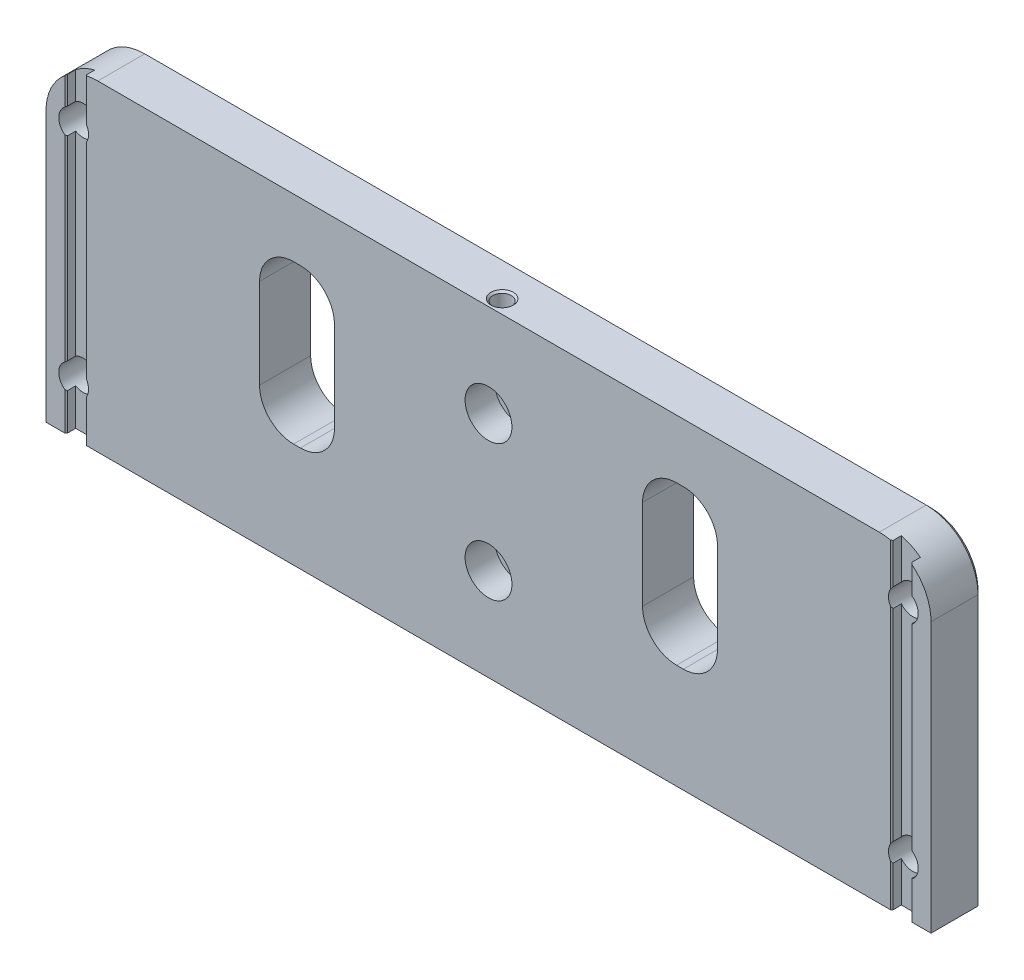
ISO-10303-21;
HEADER;
FILE_DESCRIPTION(('STEP AP214'),'2;1');
FILE_NAME('part.step','',(''),(''),'','','');
FILE_SCHEMA(('AUTOMOTIVE_DESIGN { 1 0 10303 214 1 1 1 1 }'));
ENDSEC;
DATA;
#1=APPLICATION_CONTEXT('core data for automotive mechanical design processes');
#2=APPLICATION_PROTOCOL_DEFINITION('international standard','automotive_design',2000,#1);
#3=PRODUCT_CONTEXT('',#1,'mechanical');
#4=PRODUCT('Part','Part','',(#3));
#5=PRODUCT_RELATED_PRODUCT_CATEGORY('part','',(#4));
#6=PRODUCT_DEFINITION_FORMATION('','',#4);
#7=PRODUCT_DEFINITION_CONTEXT('part definition',#1,'design');
#8=PRODUCT_DEFINITION('design','',#6,#7);
#9=PRODUCT_DEFINITION_SHAPE('','',#8);
#10=(LENGTH_UNIT() NAMED_UNIT(*) SI_UNIT(.MILLI.,.METRE.));
#11=(NAMED_UNIT(*) PLANE_ANGLE_UNIT() SI_UNIT($,.RADIAN.));
#12=(NAMED_UNIT(*) SI_UNIT($,.STERADIAN.) SOLID_ANGLE_UNIT());
#13=UNCERTAINTY_MEASURE_WITH_UNIT(LENGTH_MEASURE(1.E-05),#10,'distance_accuracy_value','');
#14=(GEOMETRIC_REPRESENTATION_CONTEXT(3) GLOBAL_UNCERTAINTY_ASSIGNED_CONTEXT((#13)) GLOBAL_UNIT_ASSIGNED_CONTEXT((#10,
#11,#12)) REPRESENTATION_CONTEXT('',''));
#15=CARTESIAN_POINT('',(0.,0.,0.));
#16=DIRECTION('',(0.,0.,1.));
#17=DIRECTION('',(1.,0.,0.));
#18=AXIS2_PLACEMENT_3D('',#15,#16,#17);
#19=CARTESIAN_POINT('',(78.7654,60.198,-16.256));
#20=DIRECTION('',(0.,-1.,0.));
#21=DIRECTION('',(1.,0.,0.));
#22=AXIS2_PLACEMENT_3D('',#19,#20,#21);
#23=PLANE('',#22);
#24=DIRECTION('',(0.,0.,1.));
#25=VECTOR('',#24,1.);
#26=CARTESIAN_POINT('',(72.8726,60.198,-25.781));
#27=LINE('',#26,#25);
#28=CARTESIAN_POINT('',(72.8726,60.198,-16.256));
#29=VERTEX_POINT('',#28);
#30=CARTESIAN_POINT('',(72.8726,60.198,-25.019));
#31=VERTEX_POINT('',#30);
#32=EDGE_CURVE('E808',#29,#31,#27,.F.);
#33=ORIENTED_EDGE('',*,*,#32,.T.);
#34=DIRECTION('',(-1.,0.,0.));
#35=VECTOR('',#34,1.);
#36=CARTESIAN_POINT('',(-72.8726,60.198,-25.019));
#37=LINE('',#36,#35);
#38=CARTESIAN_POINT('',(-72.8726,60.198,-25.019));
#39=VERTEX_POINT('',#38);
#40=EDGE_CURVE('E845',#31,#39,#37,.T.);
#41=ORIENTED_EDGE('',*,*,#40,.T.);
#42=DIRECTION('',(0.,0.,1.));
#43=VECTOR('',#42,1.);
#44=CARTESIAN_POINT('',(-72.8726,60.198,-16.256));
#45=LINE('',#44,#43);
#46=CARTESIAN_POINT('',(-72.8726,60.198,-16.256));
#47=VERTEX_POINT('',#46);
#48=EDGE_CURVE('E806',#39,#47,#45,.T.);
#49=ORIENTED_EDGE('',*,*,#48,.T.);
#50=DIRECTION('',(-1.,0.,0.));
#51=VECTOR('',#50,1.);
#52=CARTESIAN_POINT('',(73.8378,60.198,-16.256));
#53=LINE('',#52,#51);
#54=EDGE_CURVE('E540',#29,#47,#53,.T.);
#55=ORIENTED_EDGE('',*,*,#54,.F.);
#56=EDGE_LOOP('',(#33,#41,#49,#55));
#57=FACE_BOUND('',#56,.T.);
#58=DIRECTION('',(0.999999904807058,0.,0.000436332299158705));
#59=VECTOR('',#58,1.);
#60=CARTESIAN_POINT('',(2.08279980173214,60.198,-18.7950912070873));
#61=LINE('',#60,#59);
#62=CARTESIAN_POINT('',(2.08305380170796,60.198,-18.7950910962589));
#63=VERTEX_POINT('',#62);
#64=CARTESIAN_POINT('',(2.08279980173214,60.198,-18.7950912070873));
#65=VERTEX_POINT('',#64);
#66=EDGE_CURVE('E957',#63,#65,#61,.F.);
#67=ORIENTED_EDGE('',*,*,#66,.F.);
#68=CARTESIAN_POINT('',(0.,60.198,-18.796));
#69=DIRECTION('',(0.,1.,0.));
#70=DIRECTION('',(0.,0.,1.));
#71=AXIS2_PLACEMENT_3D('',#68,#69,#70);
#72=CIRCLE('',#71,2.083054);
#73=CARTESIAN_POINT('',(2.083054,60.198,-18.796));
#74=VERTEX_POINT('',#73);
#75=EDGE_CURVE('E988',#74,#63,#72,.T.);
#76=ORIENTED_EDGE('',*,*,#75,.F.);
#77=DIRECTION('',(1.,0.,0.));
#78=VECTOR('',#77,1.);
#79=CARTESIAN_POINT('',(2.0828,60.198,-18.796));
#80=LINE('',#79,#78);
#81=CARTESIAN_POINT('',(2.0828,60.198,-18.796));
#82=VERTEX_POINT('',#81);
#83=EDGE_CURVE('E19',#74,#82,#80,.F.);
#84=ORIENTED_EDGE('',*,*,#83,.T.);
#85=CARTESIAN_POINT('',(0.,60.198,-18.796));
#86=DIRECTION('',(0.,-1.,0.));
#87=DIRECTION('',(1.,0.,0.));
#88=AXIS2_PLACEMENT_3D('',#85,#86,#87);
#89=CIRCLE('',#88,2.0828);
#90=EDGE_CURVE('E25',#82,#65,#89,.T.);
#91=ORIENTED_EDGE('',*,*,#90,.T.);
#92=EDGE_LOOP('',(#67,#76,#84,#91));
#93=FACE_BOUND('',#92,.T.);
#94=ADVANCED_FACE('F15',(#57,#93),#23,.F.);
#95=CARTESIAN_POINT('',(-82.5246,60.198,-25.781));
#96=DIRECTION('',(0.,0.,-1.));
#97=DIRECTION('',(-1.,0.,0.));
#98=AXIS2_PLACEMENT_3D('',#95,#96,#97);
#99=PLANE('',#98);
#100=DIRECTION('',(1.,0.,0.));
#101=VECTOR('',#100,1.);
#102=CARTESIAN_POINT('',(72.8726,59.436,-25.781));
#103=LINE('',#102,#101);
#104=CARTESIAN_POINT('',(-72.8726,59.436,-25.781));
#105=VERTEX_POINT('',#104);
#106=CARTESIAN_POINT('',(72.8726,59.436,-25.781));
#107=VERTEX_POINT('',#106);
#108=EDGE_CURVE('E825',#105,#107,#103,.T.);
#109=ORIENTED_EDGE('',*,*,#108,.T.);
#110=CARTESIAN_POINT('',(72.8726,50.546,-25.781));
#111=DIRECTION('',(0.,0.,-1.));
#112=DIRECTION('',(-1.,0.,0.));
#113=AXIS2_PLACEMENT_3D('',#110,#111,#112);
#114=CIRCLE('',#113,8.89);
#115=CARTESIAN_POINT('',(81.7626,50.546,-25.781));
#116=VERTEX_POINT('',#115);
#117=EDGE_CURVE('E833',#107,#116,#114,.T.);
#118=ORIENTED_EDGE('',*,*,#117,.T.);
#119=DIRECTION('',(0.,-1.,0.));
#120=VECTOR('',#119,1.);
#121=CARTESIAN_POINT('',(81.7626,60.198,-25.781));
#122=LINE('',#121,#120);
#123=CARTESIAN_POINT('',(81.7626,1.016,-25.781));
#124=VERTEX_POINT('',#123);
#125=EDGE_CURVE('E831',#116,#124,#122,.T.);
#126=ORIENTED_EDGE('',*,*,#125,.T.);
#127=DIRECTION('',(-1.,0.,0.));
#128=VECTOR('',#127,1.);
#129=CARTESIAN_POINT('',(-82.5246,1.016,-25.781));
#130=LINE('',#129,#128);
#131=CARTESIAN_POINT('',(-81.7626,1.016,-25.781));
#132=VERTEX_POINT('',#131);
#133=EDGE_CURVE('E829',#124,#132,#130,.T.);
#134=ORIENTED_EDGE('',*,*,#133,.T.);
#135=DIRECTION('',(0.,1.,0.));
#136=VECTOR('',#135,1.);
#137=CARTESIAN_POINT('',(-81.7626,50.546,-25.781));
#138=LINE('',#137,#136);
#139=CARTESIAN_POINT('',(-81.7626,50.546,-25.781));
#140=VERTEX_POINT('',#139);
#141=EDGE_CURVE('E827',#132,#140,#138,.T.);
#142=ORIENTED_EDGE('',*,*,#141,.T.);
#143=CARTESIAN_POINT('',(-72.8726,50.546,-25.781));
#144=DIRECTION('',(0.,0.,-1.));
#145=DIRECTION('',(-1.,0.,0.));
#146=AXIS2_PLACEMENT_3D('',#143,#144,#145);
#147=CIRCLE('',#146,8.89);
#148=EDGE_CURVE('E823',#140,#105,#147,.T.);
#149=ORIENTED_EDGE('',*,*,#148,.T.);
#150=EDGE_LOOP('',(#109,#118,#126,#134,#142,#149));
#151=FACE_BOUND('',#150,.T.);
#152=CARTESIAN_POINT('',(0.,42.926,-25.780999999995));
#153=DIRECTION('',(0.,0.,-1.));
#154=DIRECTION('',(-1.,0.,0.));
#155=AXIS2_PLACEMENT_3D('',#152,#153,#154);
#156=CIRCLE('',#155,2.778125);
#157=CARTESIAN_POINT('',(-2.778125,42.926,-25.780999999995));
#158=VERTEX_POINT('',#157);
#159=EDGE_CURVE('E664',#158,#158,#156,.T.);
#160=ORIENTED_EDGE('',*,*,#159,.F.);
#161=EDGE_LOOP('',(#160));
#162=FACE_BOUND('',#161,.T.);
#163=CARTESIAN_POINT('',(0.,17.526,-25.780999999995));
#164=DIRECTION('',(0.,0.,-1.));
#165=DIRECTION('',(-1.,0.,0.));
#166=AXIS2_PLACEMENT_3D('',#163,#164,#165);
#167=CIRCLE('',#166,2.778125);
#168=CARTESIAN_POINT('',(-2.778125,17.526,-25.780999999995));
#169=VERTEX_POINT('',#168);
#170=EDGE_CURVE('E579',#169,#169,#167,.T.);
#171=ORIENTED_EDGE('',*,*,#170,.F.);
#172=EDGE_LOOP('',(#171));
#173=FACE_BOUND('',#172,.T.);
#174=DIRECTION('',(0.,1.,0.));
#175=VECTOR('',#174,1.);
#176=CARTESIAN_POINT('',(42.6974,60.198,-25.781));
#177=LINE('',#176,#175);
#178=CARTESIAN_POINT('',(42.6974,26.162,-25.781));
#179=VERTEX_POINT('',#178);
#180=CARTESIAN_POINT('',(42.6974,42.926,-25.781));
#181=VERTEX_POINT('',#180);
#182=EDGE_CURVE('E703',#179,#181,#177,.T.);
#183=ORIENTED_EDGE('',*,*,#182,.T.);
#184=CARTESIAN_POINT('',(36.3474,42.926,-25.781));
#185=DIRECTION('',(0.,0.,-1.));
#186=DIRECTION('',(-1.,0.,0.));
#187=AXIS2_PLACEMENT_3D('',#184,#185,#186);
#188=CIRCLE('',#187,6.35);
#189=CARTESIAN_POINT('',(36.3474,49.276,-25.781));
#190=VERTEX_POINT('',#189);
#191=EDGE_CURVE('E680',#181,#190,#188,.F.);
#192=ORIENTED_EDGE('',*,*,#191,.T.);
#193=DIRECTION('',(-1.,0.,0.));
#194=VECTOR('',#193,1.);
#195=CARTESIAN_POINT('',(-82.5246,49.276,-25.781));
#196=LINE('',#195,#194);
#197=CARTESIAN_POINT('',(35.0774,49.276,-25.781));
#198=VERTEX_POINT('',#197);
#199=EDGE_CURVE('E706',#190,#198,#196,.T.);
#200=ORIENTED_EDGE('',*,*,#199,.T.);
#201=CARTESIAN_POINT('',(35.0774,42.926,-25.781));
#202=DIRECTION('',(0.,0.,-1.));
#203=DIRECTION('',(-1.,0.,0.));
#204=AXIS2_PLACEMENT_3D('',#201,#202,#203);
#205=CIRCLE('',#204,6.35);
#206=CARTESIAN_POINT('',(28.7274,42.926,-25.781));
#207=VERTEX_POINT('',#206);
#208=EDGE_CURVE('E748',#198,#207,#205,.F.);
#209=ORIENTED_EDGE('',*,*,#208,.T.);
#210=DIRECTION('',(0.,-1.,0.));
#211=VECTOR('',#210,1.);
#212=CARTESIAN_POINT('',(28.7274,60.198,-25.781));
#213=LINE('',#212,#211);
#214=CARTESIAN_POINT('',(28.7274,26.162,-25.781));
#215=VERTEX_POINT('',#214);
#216=EDGE_CURVE('E771',#207,#215,#213,.T.);
#217=ORIENTED_EDGE('',*,*,#216,.T.);
#218=CARTESIAN_POINT('',(35.0774,26.162,-25.781));
#219=DIRECTION('',(0.,0.,-1.));
#220=DIRECTION('',(-1.,0.,0.));
#221=AXIS2_PLACEMENT_3D('',#218,#219,#220);
#222=CIRCLE('',#221,6.35);
#223=CARTESIAN_POINT('',(35.0774,19.812,-25.781));
#224=VERTEX_POINT('',#223);
#225=EDGE_CURVE('E697',#215,#224,#222,.F.);
#226=ORIENTED_EDGE('',*,*,#225,.T.);
#227=DIRECTION('',(1.,0.,0.));
#228=VECTOR('',#227,1.);
#229=CARTESIAN_POINT('',(-82.5246,19.812,-25.781));
#230=LINE('',#229,#228);
#231=CARTESIAN_POINT('',(36.3474,19.812,-25.781));
#232=VERTEX_POINT('',#231);
#233=EDGE_CURVE('E571',#224,#232,#230,.T.);
#234=ORIENTED_EDGE('',*,*,#233,.T.);
#235=CARTESIAN_POINT('',(36.3474,26.162,-25.781));
#236=DIRECTION('',(0.,0.,-1.));
#237=DIRECTION('',(-1.,0.,0.));
#238=AXIS2_PLACEMENT_3D('',#235,#236,#237);
#239=CIRCLE('',#238,6.35);
#240=EDGE_CURVE('E689',#232,#179,#239,.F.);
#241=ORIENTED_EDGE('',*,*,#240,.T.);
#242=EDGE_LOOP('',(#183,#192,#200,#209,#217,#226,#234,#241));
#243=FACE_BOUND('',#242,.T.);
#244=CARTESIAN_POINT('',(-77.3684,50.673,-25.781));
#245=DIRECTION('',(0.,0.,-1.));
#246=DIRECTION('',(-1.,0.,0.));
#247=AXIS2_PLACEMENT_3D('',#244,#245,#246);
#248=CIRCLE('',#247,2.778125);
#249=CARTESIAN_POINT('',(-80.146525,50.673,-25.781));
#250=VERTEX_POINT('',#249);
#251=EDGE_CURVE('E567',#250,#250,#248,.T.);
#252=ORIENTED_EDGE('',*,*,#251,.F.);
#253=EDGE_LOOP('',(#252));
#254=FACE_BOUND('',#253,.T.);
#255=CARTESIAN_POINT('',(77.3684,50.673,-25.781));
#256=DIRECTION('',(0.,0.,-1.));
#257=DIRECTION('',(-1.,0.,0.));
#258=AXIS2_PLACEMENT_3D('',#255,#256,#257);
#259=CIRCLE('',#258,2.778125);
#260=CARTESIAN_POINT('',(74.590275,50.673,-25.781));
#261=VERTEX_POINT('',#260);
#262=EDGE_CURVE('E555',#261,#261,#259,.T.);
#263=ORIENTED_EDGE('',*,*,#262,.F.);
#264=EDGE_LOOP('',(#263));
#265=FACE_BOUND('',#264,.T.);
#266=CARTESIAN_POINT('',(77.3684,9.525,-25.781));
#267=DIRECTION('',(0.,0.,-1.));
#268=DIRECTION('',(-1.,0.,0.));
#269=AXIS2_PLACEMENT_3D('',#266,#267,#268);
#270=CIRCLE('',#269,2.778125);
#271=CARTESIAN_POINT('',(74.590275,9.525,-25.781));
#272=VERTEX_POINT('',#271);
#273=EDGE_CURVE('E580',#272,#272,#270,.T.);
#274=ORIENTED_EDGE('',*,*,#273,.F.);
#275=EDGE_LOOP('',(#274));
#276=FACE_BOUND('',#275,.T.);
#277=CARTESIAN_POINT('',(-77.3684,9.525,-25.781));
#278=DIRECTION('',(0.,0.,-1.));
#279=DIRECTION('',(-1.,0.,0.));
#280=AXIS2_PLACEMENT_3D('',#277,#278,#279);
#281=CIRCLE('',#280,2.778125);
#282=CARTESIAN_POINT('',(-80.146525,9.525,-25.781));
#283=VERTEX_POINT('',#282);
#284=EDGE_CURVE('E592',#283,#283,#281,.T.);
#285=ORIENTED_EDGE('',*,*,#284,.F.);
#286=EDGE_LOOP('',(#285));
#287=FACE_BOUND('',#286,.T.);
#288=DIRECTION('',(0.,-1.,0.));
#289=VECTOR('',#288,1.);
#290=CARTESIAN_POINT('',(-42.6974,60.198,-25.781));
#291=LINE('',#290,#289);
#292=CARTESIAN_POINT('',(-42.6974,42.926,-25.781));
#293=VERTEX_POINT('',#292);
#294=CARTESIAN_POINT('',(-42.6974,26.162,-25.781));
#295=VERTEX_POINT('',#294);
#296=EDGE_CURVE('E744',#293,#295,#291,.T.);
#297=ORIENTED_EDGE('',*,*,#296,.T.);
#298=CARTESIAN_POINT('',(-36.3474,26.162,-25.781));
#299=DIRECTION('',(0.,0.,-1.));
#300=DIRECTION('',(-1.,0.,0.));
#301=AXIS2_PLACEMENT_3D('',#298,#299,#300);
#302=CIRCLE('',#301,6.35);
#303=CARTESIAN_POINT('',(-36.3474,19.812,-25.781));
#304=VERTEX_POINT('',#303);
#305=EDGE_CURVE('E758',#295,#304,#302,.F.);
#306=ORIENTED_EDGE('',*,*,#305,.T.);
#307=DIRECTION('',(1.,0.,0.));
#308=VECTOR('',#307,1.);
#309=CARTESIAN_POINT('',(-82.5246,19.812,-25.781));
#310=LINE('',#309,#308);
#311=CARTESIAN_POINT('',(-35.0774,19.812,-25.781));
#312=VERTEX_POINT('',#311);
#313=EDGE_CURVE('E745',#304,#312,#310,.T.);
#314=ORIENTED_EDGE('',*,*,#313,.T.);
#315=CARTESIAN_POINT('',(-35.0774,26.162,-25.781));
#316=DIRECTION('',(0.,0.,-1.));
#317=DIRECTION('',(-1.,0.,0.));
#318=AXIS2_PLACEMENT_3D('',#315,#316,#317);
#319=CIRCLE('',#318,6.35);
#320=CARTESIAN_POINT('',(-28.7274,26.162,-25.781));
#321=VERTEX_POINT('',#320);
#322=EDGE_CURVE('E728',#312,#321,#319,.F.);
#323=ORIENTED_EDGE('',*,*,#322,.T.);
#324=DIRECTION('',(0.,1.,0.));
#325=VECTOR('',#324,1.);
#326=CARTESIAN_POINT('',(-28.7274,60.198,-25.781));
#327=LINE('',#326,#325);
#328=CARTESIAN_POINT('',(-28.7274,42.926,-25.781));
#329=VERTEX_POINT('',#328);
#330=EDGE_CURVE('E734',#321,#329,#327,.T.);
#331=ORIENTED_EDGE('',*,*,#330,.T.);
#332=CARTESIAN_POINT('',(-35.0774,42.926,-25.781));
#333=DIRECTION('',(0.,0.,-1.));
#334=DIRECTION('',(-1.,0.,0.));
#335=AXIS2_PLACEMENT_3D('',#332,#333,#334);
#336=CIRCLE('',#335,6.35);
#337=CARTESIAN_POINT('',(-35.0774,49.276,-25.781));
#338=VERTEX_POINT('',#337);
#339=EDGE_CURVE('E548',#329,#338,#336,.F.);
#340=ORIENTED_EDGE('',*,*,#339,.T.);
#341=DIRECTION('',(-1.,0.,0.));
#342=VECTOR('',#341,1.);
#343=CARTESIAN_POINT('',(-82.5246,49.276,-25.781));
#344=LINE('',#343,#342);
#345=CARTESIAN_POINT('',(-36.3474,49.276,-25.781));
#346=VERTEX_POINT('',#345);
#347=EDGE_CURVE('E738',#338,#346,#344,.T.);
#348=ORIENTED_EDGE('',*,*,#347,.T.);
#349=CARTESIAN_POINT('',(-36.3474,42.926,-25.781));
#350=DIRECTION('',(0.,0.,-1.));
#351=DIRECTION('',(-1.,0.,0.));
#352=AXIS2_PLACEMENT_3D('',#349,#350,#351);
#353=CIRCLE('',#352,6.35);
#354=EDGE_CURVE('E722',#346,#293,#353,.F.);
#355=ORIENTED_EDGE('',*,*,#354,.T.);
#356=EDGE_LOOP('',(#297,#306,#314,#323,#331,#340,#348,#355));
#357=FACE_BOUND('',#356,.T.);
#358=ADVANCED_FACE('F1024',(#151,#162,#173,#243,#254,#265,#276,#287,#357),#99,.T.);
#359=CARTESIAN_POINT('',(78.7654,60.198,-16.256));
#360=DIRECTION('',(0.,0.,-1.));
#361=DIRECTION('',(-1.,0.,0.));
#362=AXIS2_PLACEMENT_3D('',#359,#360,#361);
#363=PLANE('',#362);
#364=CARTESIAN_POINT('',(77.3684,9.525,-16.256));
#365=DIRECTION('',(0.,0.,-1.));
#366=DIRECTION('',(-1.,0.,0.));
#367=AXIS2_PLACEMENT_3D('',#364,#365,#366);
#368=CIRCLE('',#367,2.778125);
#369=CARTESIAN_POINT('',(79.0194,11.7593181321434,-16.256));
#370=VERTEX_POINT('',#369);
#371=CARTESIAN_POINT('',(79.0194,7.29068186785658,-16.256));
#372=VERTEX_POINT('',#371);
#373=EDGE_CURVE('E588',#370,#372,#368,.T.);
#374=ORIENTED_EDGE('',*,*,#373,.T.);
#375=DIRECTION('',(0.,-1.,0.));
#376=VECTOR('',#375,1.);
#377=CARTESIAN_POINT('',(79.0194,60.198,-16.256));
#378=LINE('',#377,#376);
#379=CARTESIAN_POINT('',(79.0194,0.254,-16.256));
#380=VERTEX_POINT('',#379);
#381=EDGE_CURVE('E919',#372,#380,#378,.T.);
#382=ORIENTED_EDGE('',*,*,#381,.T.);
#383=DIRECTION('',(1.,0.,0.));
#384=VECTOR('',#383,1.);
#385=CARTESIAN_POINT('',(78.7654,0.254,-16.256));
#386=LINE('',#385,#384);
#387=CARTESIAN_POINT('',(82.5246,0.254,-16.256));
#388=VERTEX_POINT('',#387);
#389=EDGE_CURVE('E501',#380,#388,#386,.T.);
#390=ORIENTED_EDGE('',*,*,#389,.T.);
#391=DIRECTION('',(0.,-1.,0.));
#392=VECTOR('',#391,1.);
#393=CARTESIAN_POINT('',(82.5246,60.198,-16.256));
#394=LINE('',#393,#392);
#395=CARTESIAN_POINT('',(82.5246,50.546,-16.256));
#396=VERTEX_POINT('',#395);
#397=EDGE_CURVE('E518',#396,#388,#394,.T.);
#398=ORIENTED_EDGE('',*,*,#397,.F.);
#399=CARTESIAN_POINT('',(72.8726,50.546,-16.256));
#400=DIRECTION('',(0.,0.,-1.));
#401=DIRECTION('',(-1.,0.,0.));
#402=AXIS2_PLACEMENT_3D('',#399,#400,#401);
#403=CIRCLE('',#402,9.652);
#404=CARTESIAN_POINT('',(79.0194,57.9876364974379,-16.256));
#405=VERTEX_POINT('',#404);
#406=EDGE_CURVE('E792',#396,#405,#403,.F.);
#407=ORIENTED_EDGE('',*,*,#406,.T.);
#408=DIRECTION('',(0.,-1.,0.));
#409=VECTOR('',#408,1.);
#410=CARTESIAN_POINT('',(79.0194,60.198,-16.256));
#411=LINE('',#410,#409);
#412=CARTESIAN_POINT('',(79.0194,52.9073181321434,-16.256));
#413=VERTEX_POINT('',#412);
#414=EDGE_CURVE('E913',#405,#413,#411,.T.);
#415=ORIENTED_EDGE('',*,*,#414,.T.);
#416=CARTESIAN_POINT('',(77.3684,50.673,-16.256));
#417=DIRECTION('',(0.,0.,-1.));
#418=DIRECTION('',(-1.,0.,0.));
#419=AXIS2_PLACEMENT_3D('',#416,#417,#418);
#420=CIRCLE('',#419,2.778125);
#421=CARTESIAN_POINT('',(79.0194,48.4386818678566,-16.256));
#422=VERTEX_POINT('',#421);
#423=EDGE_CURVE('E584',#413,#422,#420,.T.);
#424=ORIENTED_EDGE('',*,*,#423,.T.);
#425=DIRECTION('',(0.,-1.,0.));
#426=VECTOR('',#425,1.);
#427=CARTESIAN_POINT('',(79.0194,60.198,-16.256));
#428=LINE('',#427,#426);
#429=EDGE_CURVE('E916',#422,#370,#428,.T.);
#430=ORIENTED_EDGE('',*,*,#429,.T.);
#431=EDGE_LOOP('',(#374,#382,#390,#398,#407,#415,#424,#430));
#432=FACE_BOUND('',#431,.T.);
#433=ADVANCED_FACE('F1030',(#432),#363,.F.);
#434=CARTESIAN_POINT('',(73.8378,60.198,-16.256));
#435=DIRECTION('',(0.,0.,1.));
#436=DIRECTION('',(1.,0.,0.));
#437=AXIS2_PLACEMENT_3D('',#434,#435,#436);
#438=PLANE('',#437);
#439=CARTESIAN_POINT('',(-77.3684,9.525,-16.256));
#440=DIRECTION('',(0.,0.,1.));
#441=DIRECTION('',(1.,0.,0.));
#442=AXIS2_PLACEMENT_3D('',#439,#440,#441);
#443=CIRCLE('',#442,2.778125);
#444=CARTESIAN_POINT('',(-74.9554,8.14826127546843,-16.256));
#445=VERTEX_POINT('',#444);
#446=CARTESIAN_POINT('',(-74.9554,10.9017387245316,-16.256));
#447=VERTEX_POINT('',#446);
#448=EDGE_CURVE('E604',#445,#447,#443,.T.);
#449=ORIENTED_EDGE('',*,*,#448,.F.);
#450=DIRECTION('',(0.,-1.,0.));
#451=VECTOR('',#450,1.);
#452=CARTESIAN_POINT('',(-74.9554,60.198,-16.256));
#453=LINE('',#452,#451);
#454=CARTESIAN_POINT('',(-74.9554,0.254,-16.256));
#455=VERTEX_POINT('',#454);
#456=EDGE_CURVE('E861',#445,#455,#453,.T.);
#457=ORIENTED_EDGE('',*,*,#456,.T.);
#458=DIRECTION('',(-1.,0.,0.));
#459=VECTOR('',#458,1.);
#460=CARTESIAN_POINT('',(73.8378,0.254,-16.256));
#461=LINE('',#460,#459);
#462=CARTESIAN_POINT('',(74.9554,0.254,-16.256));
#463=VERTEX_POINT('',#462);
#464=EDGE_CURVE('E515',#463,#455,#461,.T.);
#465=ORIENTED_EDGE('',*,*,#464,.F.);
#466=DIRECTION('',(0.,1.,0.));
#467=VECTOR('',#466,1.);
#468=CARTESIAN_POINT('',(74.9554,7.77665863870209,-16.256));
#469=LINE('',#468,#467);
#470=CARTESIAN_POINT('',(74.9554,8.14826127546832,-16.256));
#471=VERTEX_POINT('',#470);
#472=EDGE_CURVE('E853',#463,#471,#469,.T.);
#473=ORIENTED_EDGE('',*,*,#472,.T.);
#474=CARTESIAN_POINT('',(77.3684,9.525,-16.256));
#475=DIRECTION('',(0.,0.,1.));
#476=DIRECTION('',(1.,0.,0.));
#477=AXIS2_PLACEMENT_3D('',#474,#475,#476);
#478=CIRCLE('',#477,2.778125);
#479=CARTESIAN_POINT('',(74.9554,10.9017387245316,-16.256));
#480=VERTEX_POINT('',#479);
#481=EDGE_CURVE('E601',#480,#471,#478,.T.);
#482=ORIENTED_EDGE('',*,*,#481,.F.);
#483=DIRECTION('',(0.,1.,0.));
#484=VECTOR('',#483,1.);
#485=CARTESIAN_POINT('',(74.9554,48.9246586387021,-16.256));
#486=LINE('',#485,#484);
#487=CARTESIAN_POINT('',(74.9554,49.2962612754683,-16.256));
#488=VERTEX_POINT('',#487);
#489=EDGE_CURVE('E851',#480,#488,#486,.T.);
#490=ORIENTED_EDGE('',*,*,#489,.T.);
#491=CARTESIAN_POINT('',(77.3684,50.673,-16.256));
#492=DIRECTION('',(0.,0.,1.));
#493=DIRECTION('',(1.,0.,0.));
#494=AXIS2_PLACEMENT_3D('',#491,#492,#493);
#495=CIRCLE('',#494,2.778125);
#496=CARTESIAN_POINT('',(74.9554,52.0497387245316,-16.256));
#497=VERTEX_POINT('',#496);
#498=EDGE_CURVE('E572',#497,#488,#495,.T.);
#499=ORIENTED_EDGE('',*,*,#498,.F.);
#500=DIRECTION('',(0.,1.,0.));
#501=VECTOR('',#500,1.);
#502=CARTESIAN_POINT('',(74.9554,59.9108528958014,-16.256));
#503=LINE('',#502,#501);
#504=CARTESIAN_POINT('',(74.9554,59.9705980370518,-16.256));
#505=VERTEX_POINT('',#504);
#506=EDGE_CURVE('E849',#497,#505,#503,.T.);
#507=ORIENTED_EDGE('',*,*,#506,.T.);
#508=CARTESIAN_POINT('',(72.8726,50.546,-16.256));
#509=DIRECTION('',(0.,0.,1.));
#510=DIRECTION('',(1.,0.,0.));
#511=AXIS2_PLACEMENT_3D('',#508,#509,#510);
#512=CIRCLE('',#511,9.652);
#513=EDGE_CURVE('E804',#505,#29,#512,.T.);
#514=ORIENTED_EDGE('',*,*,#513,.T.);
#515=ORIENTED_EDGE('',*,*,#54,.T.);
#516=CARTESIAN_POINT('',(-72.8726,50.546,-16.256));
#517=DIRECTION('',(0.,0.,1.));
#518=DIRECTION('',(1.,0.,0.));
#519=AXIS2_PLACEMENT_3D('',#516,#517,#518);
#520=CIRCLE('',#519,9.652);
#521=CARTESIAN_POINT('',(-74.9554,59.9705980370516,-16.256));
#522=VERTEX_POINT('',#521);
#523=EDGE_CURVE('E801',#47,#522,#520,.T.);
#524=ORIENTED_EDGE('',*,*,#523,.T.);
#525=DIRECTION('',(0.,-1.,0.));
#526=VECTOR('',#525,1.);
#527=CARTESIAN_POINT('',(-74.9554,60.198,-16.256));
#528=LINE('',#527,#526);
#529=CARTESIAN_POINT('',(-74.9554,52.0497387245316,-16.256));
#530=VERTEX_POINT('',#529);
#531=EDGE_CURVE('E855',#522,#530,#528,.T.);
#532=ORIENTED_EDGE('',*,*,#531,.T.);
#533=CARTESIAN_POINT('',(-77.3684,50.673,-16.256));
#534=DIRECTION('',(0.,0.,1.));
#535=DIRECTION('',(1.,0.,0.));
#536=AXIS2_PLACEMENT_3D('',#533,#534,#535);
#537=CIRCLE('',#536,2.778125);
#538=CARTESIAN_POINT('',(-74.9554,49.2962612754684,-16.256));
#539=VERTEX_POINT('',#538);
#540=EDGE_CURVE('E568',#539,#530,#537,.T.);
#541=ORIENTED_EDGE('',*,*,#540,.F.);
#542=DIRECTION('',(0.,-1.,0.));
#543=VECTOR('',#542,1.);
#544=CARTESIAN_POINT('',(-74.9554,60.198,-16.256));
#545=LINE('',#544,#543);
#546=EDGE_CURVE('E858',#539,#447,#545,.T.);
#547=ORIENTED_EDGE('',*,*,#546,.T.);
#548=EDGE_LOOP('',(#449,#457,#465,#473,#482,#490,#499,#507,#514,#515,#524,#532,#541,#547));
#549=FACE_BOUND('',#548,.T.);
#550=CARTESIAN_POINT('',(0.,42.926,-16.256));
#551=DIRECTION('',(0.,0.,1.));
#552=DIRECTION('',(1.,0.,0.));
#553=AXIS2_PLACEMENT_3D('',#550,#551,#552);
#554=CIRCLE('',#553,4.365625);
#555=CARTESIAN_POINT('',(4.365625,42.926,-16.256));
#556=VERTEX_POINT('',#555);
#557=EDGE_CURVE('E521',#556,#556,#554,.F.);
#558=ORIENTED_EDGE('',*,*,#557,.T.);
#559=EDGE_LOOP('',(#558));
#560=FACE_BOUND('',#559,.T.);
#561=CARTESIAN_POINT('',(0.,17.526,-16.256));
#562=DIRECTION('',(0.,0.,1.));
#563=DIRECTION('',(1.,0.,0.));
#564=AXIS2_PLACEMENT_3D('',#561,#562,#563);
#565=CIRCLE('',#564,4.365625);
#566=CARTESIAN_POINT('',(4.365625,17.526,-16.256));
#567=VERTEX_POINT('',#566);
#568=EDGE_CURVE('E661',#567,#567,#565,.F.);
#569=ORIENTED_EDGE('',*,*,#568,.T.);
#570=EDGE_LOOP('',(#569));
#571=FACE_BOUND('',#570,.T.);
#572=DIRECTION('',(0.,-1.,0.));
#573=VECTOR('',#572,1.);
#574=CARTESIAN_POINT('',(42.6974,60.198,-16.256));
#575=LINE('',#574,#573);
#576=CARTESIAN_POINT('',(42.6974,42.926,-16.256));
#577=VERTEX_POINT('',#576);
#578=CARTESIAN_POINT('',(42.6974,26.162,-16.256));
#579=VERTEX_POINT('',#578);
#580=EDGE_CURVE('E690',#577,#579,#575,.T.);
#581=ORIENTED_EDGE('',*,*,#580,.T.);
#582=CARTESIAN_POINT('',(36.3474,26.162,-16.256));
#583=DIRECTION('',(0.,0.,1.));
#584=DIRECTION('',(1.,0.,0.));
#585=AXIS2_PLACEMENT_3D('',#582,#583,#584);
#586=CIRCLE('',#585,6.35);
#587=CARTESIAN_POINT('',(36.3474,19.812,-16.256));
#588=VERTEX_POINT('',#587);
#589=EDGE_CURVE('E695',#579,#588,#586,.F.);
#590=ORIENTED_EDGE('',*,*,#589,.T.);
#591=DIRECTION('',(-1.,0.,0.));
#592=VECTOR('',#591,1.);
#593=CARTESIAN_POINT('',(73.8378,19.812,-16.256));
#594=LINE('',#593,#592);
#595=CARTESIAN_POINT('',(35.0774,19.812,-16.256));
#596=VERTEX_POINT('',#595);
#597=EDGE_CURVE('E694',#588,#596,#594,.T.);
#598=ORIENTED_EDGE('',*,*,#597,.T.);
#599=CARTESIAN_POINT('',(35.0774,26.162,-16.256));
#600=DIRECTION('',(0.,0.,1.));
#601=DIRECTION('',(1.,0.,0.));
#602=AXIS2_PLACEMENT_3D('',#599,#600,#601);
#603=CIRCLE('',#602,6.35);
#604=CARTESIAN_POINT('',(28.7274,26.162,-16.256));
#605=VERTEX_POINT('',#604);
#606=EDGE_CURVE('E687',#596,#605,#603,.F.);
#607=ORIENTED_EDGE('',*,*,#606,.T.);
#608=DIRECTION('',(0.,1.,0.));
#609=VECTOR('',#608,1.);
#610=CARTESIAN_POINT('',(28.7274,60.198,-16.256));
#611=LINE('',#610,#609);
#612=CARTESIAN_POINT('',(28.7274,42.926,-16.256));
#613=VERTEX_POINT('',#612);
#614=EDGE_CURVE('E701',#605,#613,#611,.T.);
#615=ORIENTED_EDGE('',*,*,#614,.T.);
#616=CARTESIAN_POINT('',(35.0774,42.926,-16.256));
#617=DIRECTION('',(0.,0.,1.));
#618=DIRECTION('',(1.,0.,0.));
#619=AXIS2_PLACEMENT_3D('',#616,#617,#618);
#620=CIRCLE('',#619,6.35);
#621=CARTESIAN_POINT('',(35.0774,49.276,-16.256));
#622=VERTEX_POINT('',#621);
#623=EDGE_CURVE('E682',#613,#622,#620,.F.);
#624=ORIENTED_EDGE('',*,*,#623,.T.);
#625=DIRECTION('',(1.,0.,0.));
#626=VECTOR('',#625,1.);
#627=CARTESIAN_POINT('',(73.8378,49.276,-16.256));
#628=LINE('',#627,#626);
#629=CARTESIAN_POINT('',(36.3474,49.276,-16.256));
#630=VERTEX_POINT('',#629);
#631=EDGE_CURVE('E693',#622,#630,#628,.T.);
#632=ORIENTED_EDGE('',*,*,#631,.T.);
#633=CARTESIAN_POINT('',(36.3474,42.926,-16.256));
#634=DIRECTION('',(0.,0.,1.));
#635=DIRECTION('',(1.,0.,0.));
#636=AXIS2_PLACEMENT_3D('',#633,#634,#635);
#637=CIRCLE('',#636,6.35);
#638=EDGE_CURVE('E683',#630,#577,#637,.F.);
#639=ORIENTED_EDGE('',*,*,#638,.T.);
#640=EDGE_LOOP('',(#581,#590,#598,#607,#615,#624,#632,#639));
#641=FACE_BOUND('',#640,.T.);
#642=DIRECTION('',(0.,1.,0.));
#643=VECTOR('',#642,1.);
#644=CARTESIAN_POINT('',(-42.6974,60.198,-16.256));
#645=LINE('',#644,#643);
#646=CARTESIAN_POINT('',(-42.6974,26.162,-16.256));
#647=VERTEX_POINT('',#646);
#648=CARTESIAN_POINT('',(-42.6974,42.926,-16.256));
#649=VERTEX_POINT('',#648);
#650=EDGE_CURVE('E741',#647,#649,#645,.T.);
#651=ORIENTED_EDGE('',*,*,#650,.T.);
#652=CARTESIAN_POINT('',(-36.3474,42.926,-16.256));
#653=DIRECTION('',(0.,0.,1.));
#654=DIRECTION('',(1.,0.,0.));
#655=AXIS2_PLACEMENT_3D('',#652,#653,#654);
#656=CIRCLE('',#655,6.35);
#657=CARTESIAN_POINT('',(-36.3474,49.276,-16.256));
#658=VERTEX_POINT('',#657);
#659=EDGE_CURVE('E756',#649,#658,#656,.F.);
#660=ORIENTED_EDGE('',*,*,#659,.T.);
#661=DIRECTION('',(1.,0.,0.));
#662=VECTOR('',#661,1.);
#663=CARTESIAN_POINT('',(73.8378,49.276,-16.256));
#664=LINE('',#663,#662);
#665=CARTESIAN_POINT('',(-35.0774,49.276,-16.256));
#666=VERTEX_POINT('',#665);
#667=EDGE_CURVE('E725',#658,#666,#664,.T.);
#668=ORIENTED_EDGE('',*,*,#667,.T.);
#669=CARTESIAN_POINT('',(-35.0774,42.926,-16.256));
#670=DIRECTION('',(0.,0.,1.));
#671=DIRECTION('',(1.,0.,0.));
#672=AXIS2_PLACEMENT_3D('',#669,#670,#671);
#673=CIRCLE('',#672,6.35);
#674=CARTESIAN_POINT('',(-28.7274,42.926,-16.256));
#675=VERTEX_POINT('',#674);
#676=EDGE_CURVE('E715',#666,#675,#673,.F.);
#677=ORIENTED_EDGE('',*,*,#676,.T.);
#678=DIRECTION('',(0.,-1.,0.));
#679=VECTOR('',#678,1.);
#680=CARTESIAN_POINT('',(-28.7274,60.198,-16.256));
#681=LINE('',#680,#679);
#682=CARTESIAN_POINT('',(-28.7274,26.162,-16.256));
#683=VERTEX_POINT('',#682);
#684=EDGE_CURVE('E710',#675,#683,#681,.T.);
#685=ORIENTED_EDGE('',*,*,#684,.T.);
#686=CARTESIAN_POINT('',(-35.0774,26.162,-16.256));
#687=DIRECTION('',(0.,0.,1.));
#688=DIRECTION('',(1.,0.,0.));
#689=AXIS2_PLACEMENT_3D('',#686,#687,#688);
#690=CIRCLE('',#689,6.35);
#691=CARTESIAN_POINT('',(-35.0774,19.812,-16.256));
#692=VERTEX_POINT('',#691);
#693=EDGE_CURVE('E726',#683,#692,#690,.F.);
#694=ORIENTED_EDGE('',*,*,#693,.T.);
#695=DIRECTION('',(-1.,0.,0.));
#696=VECTOR('',#695,1.);
#697=CARTESIAN_POINT('',(73.8378,19.812,-16.256));
#698=LINE('',#697,#696);
#699=CARTESIAN_POINT('',(-36.3474,19.812,-16.256));
#700=VERTEX_POINT('',#699);
#701=EDGE_CURVE('E737',#692,#700,#698,.T.);
#702=ORIENTED_EDGE('',*,*,#701,.T.);
#703=CARTESIAN_POINT('',(-36.3474,26.162,-16.256));
#704=DIRECTION('',(0.,0.,1.));
#705=DIRECTION('',(1.,0.,0.));
#706=AXIS2_PLACEMENT_3D('',#703,#704,#705);
#707=CIRCLE('',#706,6.35);
#708=EDGE_CURVE('E733',#700,#647,#707,.F.);
#709=ORIENTED_EDGE('',*,*,#708,.T.);
#710=EDGE_LOOP('',(#651,#660,#668,#677,#685,#694,#702,#709));
#711=FACE_BOUND('',#710,.T.);
#712=ADVANCED_FACE('F1037',(#549,#560,#571,#641,#711),#438,.T.);
#713=CARTESIAN_POINT('',(-78.7654,60.198,-17.78));
#714=DIRECTION('',(1.,0.,0.));
#715=DIRECTION('',(0.,0.,-1.));
#716=AXIS2_PLACEMENT_3D('',#713,#714,#715);
#717=PLANE('',#716);
#718=DIRECTION('',(0.,0.,1.));
#719=VECTOR('',#718,1.);
#720=CARTESIAN_POINT('',(-78.7654,58.1903451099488,-18.034));
#721=LINE('',#720,#719);
#722=CARTESIAN_POINT('',(-78.7654,58.1903451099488,-18.034));
#723=VERTEX_POINT('',#722);
#724=CARTESIAN_POINT('',(-78.7654,58.1903451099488,-16.51));
#725=VERTEX_POINT('',#724);
#726=EDGE_CURVE('E815',#723,#725,#721,.T.);
#727=ORIENTED_EDGE('',*,*,#726,.T.);
#728=DIRECTION('',(0.,-1.,0.));
#729=VECTOR('',#728,1.);
#730=CARTESIAN_POINT('',(-78.7654,60.198,-16.51));
#731=LINE('',#730,#729);
#732=CARTESIAN_POINT('',(-78.7654,53.0743266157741,-16.51));
#733=VERTEX_POINT('',#732);
#734=EDGE_CURVE('E910',#725,#733,#731,.T.);
#735=ORIENTED_EDGE('',*,*,#734,.T.);
#736=DIRECTION('',(0.,0.,1.));
#737=VECTOR('',#736,1.);
#738=CARTESIAN_POINT('',(-78.7654,53.0743266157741,-17.145));
#739=LINE('',#738,#737);
#740=CARTESIAN_POINT('',(-78.7654,53.0743266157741,-18.034));
#741=VERTEX_POINT('',#740);
#742=EDGE_CURVE('E556',#741,#733,#739,.T.);
#743=ORIENTED_EDGE('',*,*,#742,.F.);
#744=DIRECTION('',(0.,-1.,0.));
#745=VECTOR('',#744,1.);
#746=CARTESIAN_POINT('',(-78.7654,60.198,-18.034));
#747=LINE('',#746,#745);
#748=EDGE_CURVE('E533',#723,#741,#747,.T.);
#749=ORIENTED_EDGE('',*,*,#748,.F.);
#750=EDGE_LOOP('',(#727,#735,#743,#749));
#751=FACE_BOUND('',#750,.T.);
#752=ADVANCED_FACE('F1040',(#751),#717,.T.);
#753=CARTESIAN_POINT('',(-75.2094,60.198,-18.034));
#754=DIRECTION('',(0.,0.,1.));
#755=DIRECTION('',(1.,0.,0.));
#756=AXIS2_PLACEMENT_3D('',#753,#754,#755);
#757=PLANE('',#756);
#758=DIRECTION('',(0.,-1.,0.));
#759=VECTOR('',#758,1.);
#760=CARTESIAN_POINT('',(-75.2094,60.198,-18.034));
#761=LINE('',#760,#759);
#762=CARTESIAN_POINT('',(-75.2094,59.9108528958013,-18.034));
#763=VERTEX_POINT('',#762);
#764=CARTESIAN_POINT('',(-75.2094,52.4213413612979,-18.034));
#765=VERTEX_POINT('',#764);
#766=EDGE_CURVE('E538',#763,#765,#761,.T.);
#767=ORIENTED_EDGE('',*,*,#766,.F.);
#768=CARTESIAN_POINT('',(-72.8726,50.546,-18.034));
#769=DIRECTION('',(0.,0.,1.));
#770=DIRECTION('',(1.,0.,0.));
#771=AXIS2_PLACEMENT_3D('',#768,#769,#770);
#772=CIRCLE('',#771,9.652);
#773=EDGE_CURVE('E813',#763,#723,#772,.T.);
#774=ORIENTED_EDGE('',*,*,#773,.T.);
#775=ORIENTED_EDGE('',*,*,#748,.T.);
#776=CARTESIAN_POINT('',(-77.3684,50.673,-18.034));
#777=DIRECTION('',(0.,0.,1.));
#778=DIRECTION('',(1.,0.,0.));
#779=AXIS2_PLACEMENT_3D('',#776,#777,#778);
#780=CIRCLE('',#779,2.778125);
#781=EDGE_CURVE('E560',#765,#741,#780,.T.);
#782=ORIENTED_EDGE('',*,*,#781,.F.);
#783=EDGE_LOOP('',(#767,#774,#775,#782));
#784=FACE_BOUND('',#783,.T.);
#785=ADVANCED_FACE('F1083',(#784),#757,.T.);
#786=CARTESIAN_POINT('',(-75.2094,60.198,-16.256));
#787=DIRECTION('',(-1.,0.,0.));
#788=DIRECTION('',(0.,0.,1.));
#789=AXIS2_PLACEMENT_3D('',#786,#787,#788);
#790=PLANE('',#789);
#791=DIRECTION('',(0.,0.,1.));
#792=VECTOR('',#791,1.);
#793=CARTESIAN_POINT('',(-75.2094,11.2733413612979,-17.145));
#794=LINE('',#793,#792);
#795=CARTESIAN_POINT('',(-75.2094,11.2733413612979,-16.51));
#796=VERTEX_POINT('',#795);
#797=CARTESIAN_POINT('',(-75.2094,11.2733413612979,-18.034));
#798=VERTEX_POINT('',#797);
#799=EDGE_CURVE('E640',#796,#798,#794,.F.);
#800=ORIENTED_EDGE('',*,*,#799,.F.);
#801=DIRECTION('',(0.,1.,0.));
#802=VECTOR('',#801,1.);
#803=CARTESIAN_POINT('',(-75.2094,60.198,-16.51));
#804=LINE('',#803,#802);
#805=CARTESIAN_POINT('',(-75.2094,48.9246586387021,-16.51));
#806=VERTEX_POINT('',#805);
#807=EDGE_CURVE('E891',#796,#806,#804,.T.);
#808=ORIENTED_EDGE('',*,*,#807,.T.);
#809=DIRECTION('',(0.,0.,1.));
#810=VECTOR('',#809,1.);
#811=CARTESIAN_POINT('',(-75.2094,48.9246586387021,-17.145));
#812=LINE('',#811,#810);
#813=CARTESIAN_POINT('',(-75.2094,48.9246586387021,-18.034));
#814=VERTEX_POINT('',#813);
#815=EDGE_CURVE('E566',#814,#806,#812,.T.);
#816=ORIENTED_EDGE('',*,*,#815,.F.);
#817=EDGE_CURVE('E535',#814,#798,#761,.T.);
#818=ORIENTED_EDGE('',*,*,#817,.T.);
#819=EDGE_LOOP('',(#800,#808,#816,#818));
#820=FACE_BOUND('',#819,.T.);
#821=ADVANCED_FACE('F1048',(#820),#790,.T.);
#822=CARTESIAN_POINT('',(75.2094,60.198,-18.034));
#823=DIRECTION('',(0.,0.,-1.));
#824=DIRECTION('',(-1.,0.,0.));
#825=AXIS2_PLACEMENT_3D('',#822,#823,#824);
#826=PLANE('',#825);
#827=DIRECTION('',(0.,-1.,0.));
#828=VECTOR('',#827,1.);
#829=CARTESIAN_POINT('',(78.7654,60.198,-18.034));
#830=LINE('',#829,#828);
#831=CARTESIAN_POINT('',(78.7654,58.1903451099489,-18.034));
#832=VERTEX_POINT('',#831);
#833=CARTESIAN_POINT('',(78.7654,53.0743266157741,-18.034));
#834=VERTEX_POINT('',#833);
#835=EDGE_CURVE('E529',#832,#834,#830,.T.);
#836=ORIENTED_EDGE('',*,*,#835,.F.);
#837=CARTESIAN_POINT('',(72.8726,50.546,-18.034));
#838=DIRECTION('',(0.,0.,-1.));
#839=DIRECTION('',(-1.,0.,0.));
#840=AXIS2_PLACEMENT_3D('',#837,#838,#839);
#841=CIRCLE('',#840,9.652);
#842=CARTESIAN_POINT('',(75.2094,59.9108528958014,-18.034));
#843=VERTEX_POINT('',#842);
#844=EDGE_CURVE('E797',#832,#843,#841,.F.);
#845=ORIENTED_EDGE('',*,*,#844,.T.);
#846=DIRECTION('',(0.,-1.,0.));
#847=VECTOR('',#846,1.);
#848=CARTESIAN_POINT('',(75.2094,60.198,-18.034));
#849=LINE('',#848,#847);
#850=CARTESIAN_POINT('',(75.2094,52.4213413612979,-18.034));
#851=VERTEX_POINT('',#850);
#852=EDGE_CURVE('E525',#843,#851,#849,.T.);
#853=ORIENTED_EDGE('',*,*,#852,.T.);
#854=CARTESIAN_POINT('',(77.3684,50.673,-18.034));
#855=DIRECTION('',(0.,0.,-1.));
#856=DIRECTION('',(-1.,0.,0.));
#857=AXIS2_PLACEMENT_3D('',#854,#855,#856);
#858=CIRCLE('',#857,2.778125);
#859=EDGE_CURVE('E618',#851,#834,#858,.T.);
#860=ORIENTED_EDGE('',*,*,#859,.T.);
#861=EDGE_LOOP('',(#836,#845,#853,#860));
#862=FACE_BOUND('',#861,.T.);
#863=ADVANCED_FACE('F1078',(#862),#826,.F.);
#864=CARTESIAN_POINT('',(78.7654,60.198,-17.78));
#865=DIRECTION('',(1.,0.,0.));
#866=DIRECTION('',(0.,0.,-1.));
#867=AXIS2_PLACEMENT_3D('',#864,#865,#866);
#868=PLANE('',#867);
#869=DIRECTION('',(0.,0.,1.));
#870=VECTOR('',#869,1.);
#871=CARTESIAN_POINT('',(78.7654,53.0743266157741,-17.145));
#872=LINE('',#871,#870);
#873=CARTESIAN_POINT('',(78.7654,53.0743266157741,-16.51));
#874=VERTEX_POINT('',#873);
#875=EDGE_CURVE('E611',#834,#874,#872,.T.);
#876=ORIENTED_EDGE('',*,*,#875,.T.);
#877=DIRECTION('',(0.,1.,0.));
#878=VECTOR('',#877,1.);
#879=CARTESIAN_POINT('',(78.7654,60.198,-16.51));
#880=LINE('',#879,#878);
#881=CARTESIAN_POINT('',(78.7654,58.1903451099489,-16.51));
#882=VERTEX_POINT('',#881);
#883=EDGE_CURVE('E948',#874,#882,#880,.T.);
#884=ORIENTED_EDGE('',*,*,#883,.T.);
#885=DIRECTION('',(0.,0.,-1.));
#886=VECTOR('',#885,1.);
#887=CARTESIAN_POINT('',(78.7654,58.1903451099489,-16.256));
#888=LINE('',#887,#886);
#889=EDGE_CURVE('E795',#882,#832,#888,.T.);
#890=ORIENTED_EDGE('',*,*,#889,.T.);
#891=ORIENTED_EDGE('',*,*,#835,.T.);
#892=EDGE_LOOP('',(#876,#884,#890,#891));
#893=FACE_BOUND('',#892,.T.);
#894=ADVANCED_FACE('F1067',(#893),#868,.F.);
#895=CARTESIAN_POINT('',(75.2094,60.198,-16.256));
#896=DIRECTION('',(-1.,0.,0.));
#897=DIRECTION('',(0.,0.,1.));
#898=AXIS2_PLACEMENT_3D('',#895,#896,#897);
#899=PLANE('',#898);
#900=DIRECTION('',(0.,0.,1.));
#901=VECTOR('',#900,1.);
#902=CARTESIAN_POINT('',(75.2094,48.9246586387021,-17.145));
#903=LINE('',#902,#901);
#904=CARTESIAN_POINT('',(75.2094,48.9246586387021,-18.034));
#905=VERTEX_POINT('',#904);
#906=CARTESIAN_POINT('',(75.2094,48.9246586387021,-16.51));
#907=VERTEX_POINT('',#906);
#908=EDGE_CURVE('E622',#905,#907,#903,.T.);
#909=ORIENTED_EDGE('',*,*,#908,.T.);
#910=DIRECTION('',(0.,-1.,0.));
#911=VECTOR('',#910,1.);
#912=CARTESIAN_POINT('',(75.2094,11.2733413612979,-16.51));
#913=LINE('',#912,#911);
#914=CARTESIAN_POINT('',(75.2094,11.2733413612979,-16.51));
#915=VERTEX_POINT('',#914);
#916=EDGE_CURVE('E945',#907,#915,#913,.T.);
#917=ORIENTED_EDGE('',*,*,#916,.T.);
#918=DIRECTION('',(0.,0.,1.));
#919=VECTOR('',#918,1.);
#920=CARTESIAN_POINT('',(75.2094,11.2733413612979,-17.145));
#921=LINE('',#920,#919);
#922=CARTESIAN_POINT('',(75.2094,11.2733413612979,-18.034));
#923=VERTEX_POINT('',#922);
#924=EDGE_CURVE('E583',#915,#923,#921,.F.);
#925=ORIENTED_EDGE('',*,*,#924,.T.);
#926=EDGE_CURVE('E522',#905,#923,#849,.T.);
#927=ORIENTED_EDGE('',*,*,#926,.F.);
#928=EDGE_LOOP('',(#909,#917,#925,#927));
#929=FACE_BOUND('',#928,.T.);
#930=ADVANCED_FACE('F1073',(#929),#899,.F.);
#931=DIRECTION('',(0.,0.,1.));
#932=VECTOR('',#931,1.);
#933=CARTESIAN_POINT('',(75.2094,7.77665863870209,-17.145));
#934=LINE('',#933,#932);
#935=CARTESIAN_POINT('',(75.2094,7.77665863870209,-18.034));
#936=VERTEX_POINT('',#935);
#937=CARTESIAN_POINT('',(75.2094,7.77665863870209,-16.51));
#938=VERTEX_POINT('',#937);
#939=EDGE_CURVE('E598',#936,#938,#934,.T.);
#940=ORIENTED_EDGE('',*,*,#939,.T.);
#941=DIRECTION('',(0.,-1.,0.));
#942=VECTOR('',#941,1.);
#943=CARTESIAN_POINT('',(75.2094,0.254,-16.51));
#944=LINE('',#943,#942);
#945=CARTESIAN_POINT('',(75.2094,0.254,-16.51));
#946=VERTEX_POINT('',#945);
#947=EDGE_CURVE('E932',#938,#946,#944,.T.);
#948=ORIENTED_EDGE('',*,*,#947,.T.);
#949=DIRECTION('',(0.,0.,-1.));
#950=VECTOR('',#949,1.);
#951=CARTESIAN_POINT('',(75.2094,0.254,-16.256));
#952=LINE('',#951,#950);
#953=CARTESIAN_POINT('',(75.2094,0.254,-18.034));
#954=VERTEX_POINT('',#953);
#955=EDGE_CURVE('E513',#946,#954,#952,.T.);
#956=ORIENTED_EDGE('',*,*,#955,.T.);
#957=EDGE_CURVE('E526',#936,#954,#849,.T.);
#958=ORIENTED_EDGE('',*,*,#957,.F.);
#959=EDGE_LOOP('',(#940,#948,#956,#958));
#960=FACE_BOUND('',#959,.T.);
#961=ADVANCED_FACE('F1074',(#960),#899,.F.);
#962=CARTESIAN_POINT('',(78.7654,48.2716733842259,-18.034));
#963=VERTEX_POINT('',#962);
#964=CARTESIAN_POINT('',(78.7654,11.9263266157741,-18.034));
#965=VERTEX_POINT('',#964);
#966=EDGE_CURVE('E527',#963,#965,#830,.T.);
#967=ORIENTED_EDGE('',*,*,#966,.F.);
#968=CARTESIAN_POINT('',(77.3684,50.673,-18.034));
#969=DIRECTION('',(0.,0.,-1.));
#970=DIRECTION('',(-1.,0.,0.));
#971=AXIS2_PLACEMENT_3D('',#968,#969,#970);
#972=CIRCLE('',#971,2.778125);
#973=EDGE_CURVE('E619',#963,#905,#972,.T.);
#974=ORIENTED_EDGE('',*,*,#973,.T.);
#975=ORIENTED_EDGE('',*,*,#926,.T.);
#976=CARTESIAN_POINT('',(77.3684,9.525,-18.034));
#977=DIRECTION('',(0.,0.,-1.));
#978=DIRECTION('',(-1.,0.,0.));
#979=AXIS2_PLACEMENT_3D('',#976,#977,#978);
#980=CIRCLE('',#979,2.778125);
#981=EDGE_CURVE('E594',#923,#965,#980,.T.);
#982=ORIENTED_EDGE('',*,*,#981,.T.);
#983=EDGE_LOOP('',(#967,#974,#975,#982));
#984=FACE_BOUND('',#983,.T.);
#985=ADVANCED_FACE('F1079',(#984),#826,.F.);
#986=DIRECTION('',(0.,0.,1.));
#987=VECTOR('',#986,1.);
#988=CARTESIAN_POINT('',(78.7654,11.9263266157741,-17.145));
#989=LINE('',#988,#987);
#990=CARTESIAN_POINT('',(78.7654,11.9263266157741,-16.51));
#991=VERTEX_POINT('',#990);
#992=EDGE_CURVE('E585',#965,#991,#989,.T.);
#993=ORIENTED_EDGE('',*,*,#992,.T.);
#994=DIRECTION('',(0.,1.,0.));
#995=VECTOR('',#994,1.);
#996=CARTESIAN_POINT('',(78.7654,60.198,-16.51));
#997=LINE('',#996,#995);
#998=CARTESIAN_POINT('',(78.7654,48.2716733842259,-16.51));
#999=VERTEX_POINT('',#998);
#1000=EDGE_CURVE('E935',#991,#999,#997,.T.);
#1001=ORIENTED_EDGE('',*,*,#1000,.T.);
#1002=DIRECTION('',(0.,0.,1.));
#1003=VECTOR('',#1002,1.);
#1004=CARTESIAN_POINT('',(78.7654,48.2716733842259,-17.145));
#1005=LINE('',#1004,#1003);
#1006=EDGE_CURVE('E614',#999,#963,#1005,.F.);
#1007=ORIENTED_EDGE('',*,*,#1006,.T.);
#1008=ORIENTED_EDGE('',*,*,#966,.T.);
#1009=EDGE_LOOP('',(#993,#1001,#1007,#1008));
#1010=FACE_BOUND('',#1009,.T.);
#1011=ADVANCED_FACE('F1068',(#1010),#868,.F.);
#1012=DIRECTION('',(0.,0.,1.));
#1013=VECTOR('',#1012,1.);
#1014=CARTESIAN_POINT('',(-78.7654,48.2716733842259,-17.145));
#1015=LINE('',#1014,#1013);
#1016=CARTESIAN_POINT('',(-78.7654,48.2716733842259,-16.51));
#1017=VERTEX_POINT('',#1016);
#1018=CARTESIAN_POINT('',(-78.7654,48.2716733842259,-18.034));
#1019=VERTEX_POINT('',#1018);
#1020=EDGE_CURVE('E559',#1017,#1019,#1015,.F.);
#1021=ORIENTED_EDGE('',*,*,#1020,.F.);
#1022=DIRECTION('',(0.,-1.,0.));
#1023=VECTOR('',#1022,1.);
#1024=CARTESIAN_POINT('',(-78.7654,60.198,-16.51));
#1025=LINE('',#1024,#1023);
#1026=CARTESIAN_POINT('',(-78.7654,11.9263266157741,-16.51));
#1027=VERTEX_POINT('',#1026);
#1028=EDGE_CURVE('E901',#1017,#1027,#1025,.T.);
#1029=ORIENTED_EDGE('',*,*,#1028,.T.);
#1030=DIRECTION('',(0.,0.,1.));
#1031=VECTOR('',#1030,1.);
#1032=CARTESIAN_POINT('',(-78.7654,11.9263266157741,-17.145));
#1033=LINE('',#1032,#1031);
#1034=CARTESIAN_POINT('',(-78.7654,11.9263266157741,-18.034));
#1035=VERTEX_POINT('',#1034);
#1036=EDGE_CURVE('E632',#1035,#1027,#1033,.T.);
#1037=ORIENTED_EDGE('',*,*,#1036,.F.);
#1038=EDGE_CURVE('E531',#1019,#1035,#747,.T.);
#1039=ORIENTED_EDGE('',*,*,#1038,.F.);
#1040=EDGE_LOOP('',(#1021,#1029,#1037,#1039));
#1041=FACE_BOUND('',#1040,.T.);
#1042=ADVANCED_FACE('F1055',(#1041),#717,.T.);
#1043=CARTESIAN_POINT('',(-77.3684,50.673,-18.034));
#1044=DIRECTION('',(0.,0.,1.));
#1045=DIRECTION('',(1.,0.,0.));
#1046=AXIS2_PLACEMENT_3D('',#1043,#1044,#1045);
#1047=CIRCLE('',#1046,2.778125);
#1048=EDGE_CURVE('E563',#1019,#814,#1047,.T.);
#1049=ORIENTED_EDGE('',*,*,#1048,.F.);
#1050=ORIENTED_EDGE('',*,*,#1038,.T.);
#1051=CARTESIAN_POINT('',(-77.3684,9.525,-18.034));
#1052=DIRECTION('',(0.,0.,1.));
#1053=DIRECTION('',(1.,0.,0.));
#1054=AXIS2_PLACEMENT_3D('',#1051,#1052,#1053);
#1055=CIRCLE('',#1054,2.778125);
#1056=EDGE_CURVE('E636',#798,#1035,#1055,.T.);
#1057=ORIENTED_EDGE('',*,*,#1056,.F.);
#1058=ORIENTED_EDGE('',*,*,#817,.F.);
#1059=EDGE_LOOP('',(#1049,#1050,#1057,#1058));
#1060=FACE_BOUND('',#1059,.T.);
#1061=ADVANCED_FACE('F1084',(#1060),#757,.T.);
#1062=DIRECTION('',(0.,0.,-1.));
#1063=VECTOR('',#1062,1.);
#1064=CARTESIAN_POINT('',(-75.2094,0.254,-16.256));
#1065=LINE('',#1064,#1063);
#1066=CARTESIAN_POINT('',(-75.2094,0.254,-16.51));
#1067=VERTEX_POINT('',#1066);
#1068=CARTESIAN_POINT('',(-75.2094,0.254,-18.034));
#1069=VERTEX_POINT('',#1068);
#1070=EDGE_CURVE('E511',#1067,#1069,#1065,.T.);
#1071=ORIENTED_EDGE('',*,*,#1070,.F.);
#1072=DIRECTION('',(0.,1.,0.));
#1073=VECTOR('',#1072,1.);
#1074=CARTESIAN_POINT('',(-75.2094,60.198,-16.51));
#1075=LINE('',#1074,#1073);
#1076=CARTESIAN_POINT('',(-75.2094,7.77665863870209,-16.51));
#1077=VERTEX_POINT('',#1076);
#1078=EDGE_CURVE('E872',#1067,#1077,#1075,.T.);
#1079=ORIENTED_EDGE('',*,*,#1078,.T.);
#1080=DIRECTION('',(0.,0.,1.));
#1081=VECTOR('',#1080,1.);
#1082=CARTESIAN_POINT('',(-75.2094,7.77665863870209,-17.145));
#1083=LINE('',#1082,#1081);
#1084=CARTESIAN_POINT('',(-75.2094,7.77665863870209,-18.034));
#1085=VERTEX_POINT('',#1084);
#1086=EDGE_CURVE('E642',#1085,#1077,#1083,.T.);
#1087=ORIENTED_EDGE('',*,*,#1086,.F.);
#1088=EDGE_CURVE('E539',#1085,#1069,#761,.T.);
#1089=ORIENTED_EDGE('',*,*,#1088,.T.);
#1090=EDGE_LOOP('',(#1071,#1079,#1087,#1089));
#1091=FACE_BOUND('',#1090,.T.);
#1092=ADVANCED_FACE('F1049',(#1091),#790,.T.);
#1093=DIRECTION('',(0.,0.,-1.));
#1094=VECTOR('',#1093,1.);
#1095=CARTESIAN_POINT('',(75.2094,59.9108528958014,-18.034));
#1096=LINE('',#1095,#1094);
#1097=CARTESIAN_POINT('',(75.2094,59.9108528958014,-16.51));
#1098=VERTEX_POINT('',#1097);
#1099=EDGE_CURVE('E799',#843,#1098,#1096,.F.);
#1100=ORIENTED_EDGE('',*,*,#1099,.T.);
#1101=DIRECTION('',(0.,-1.,0.));
#1102=VECTOR('',#1101,1.);
#1103=CARTESIAN_POINT('',(75.2094,52.4213413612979,-16.51));
#1104=LINE('',#1103,#1102);
#1105=CARTESIAN_POINT('',(75.2094,52.4213413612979,-16.51));
#1106=VERTEX_POINT('',#1105);
#1107=EDGE_CURVE('E953',#1098,#1106,#1104,.T.);
#1108=ORIENTED_EDGE('',*,*,#1107,.T.);
#1109=DIRECTION('',(0.,0.,1.));
#1110=VECTOR('',#1109,1.);
#1111=CARTESIAN_POINT('',(75.2094,52.4213413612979,-17.145));
#1112=LINE('',#1111,#1110);
#1113=EDGE_CURVE('E610',#1106,#851,#1112,.F.);
#1114=ORIENTED_EDGE('',*,*,#1113,.T.);
#1115=ORIENTED_EDGE('',*,*,#852,.F.);
#1116=EDGE_LOOP('',(#1100,#1108,#1114,#1115));
#1117=FACE_BOUND('',#1116,.T.);
#1118=ADVANCED_FACE('F1069',(#1117),#899,.F.);
#1119=ORIENTED_EDGE('',*,*,#957,.T.);
#1120=DIRECTION('',(1.,0.,0.));
#1121=VECTOR('',#1120,1.);
#1122=CARTESIAN_POINT('',(75.2094,0.254,-18.034));
#1123=LINE('',#1122,#1121);
#1124=CARTESIAN_POINT('',(78.7654,0.254,-18.034));
#1125=VERTEX_POINT('',#1124);
#1126=EDGE_CURVE('E508',#954,#1125,#1123,.T.);
#1127=ORIENTED_EDGE('',*,*,#1126,.T.);
#1128=CARTESIAN_POINT('',(78.7654,7.12367338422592,-18.034));
#1129=VERTEX_POINT('',#1128);
#1130=EDGE_CURVE('E530',#1129,#1125,#830,.T.);
#1131=ORIENTED_EDGE('',*,*,#1130,.F.);
#1132=CARTESIAN_POINT('',(77.3684,9.525,-18.034));
#1133=DIRECTION('',(0.,0.,-1.));
#1134=DIRECTION('',(-1.,0.,0.));
#1135=AXIS2_PLACEMENT_3D('',#1132,#1133,#1134);
#1136=CIRCLE('',#1135,2.778125);
#1137=EDGE_CURVE('E595',#1129,#936,#1136,.T.);
#1138=ORIENTED_EDGE('',*,*,#1137,.T.);
#1139=EDGE_LOOP('',(#1119,#1127,#1131,#1138));
#1140=FACE_BOUND('',#1139,.T.);
#1141=ADVANCED_FACE('F1065',(#1140),#826,.F.);
#1142=DIRECTION('',(0.,0.,1.));
#1143=VECTOR('',#1142,1.);
#1144=CARTESIAN_POINT('',(78.7654,0.254,-17.78));
#1145=LINE('',#1144,#1143);
#1146=CARTESIAN_POINT('',(78.7654,0.254,-16.51));
#1147=VERTEX_POINT('',#1146);
#1148=EDGE_CURVE('E505',#1125,#1147,#1145,.T.);
#1149=ORIENTED_EDGE('',*,*,#1148,.T.);
#1150=DIRECTION('',(0.,1.,0.));
#1151=VECTOR('',#1150,1.);
#1152=CARTESIAN_POINT('',(78.7654,60.198,-16.51));
#1153=LINE('',#1152,#1151);
#1154=CARTESIAN_POINT('',(78.7654,7.12367338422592,-16.51));
#1155=VERTEX_POINT('',#1154);
#1156=EDGE_CURVE('E922',#1147,#1155,#1153,.T.);
#1157=ORIENTED_EDGE('',*,*,#1156,.T.);
#1158=DIRECTION('',(0.,0.,1.));
#1159=VECTOR('',#1158,1.);
#1160=CARTESIAN_POINT('',(78.7654,7.12367338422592,-17.145));
#1161=LINE('',#1160,#1159);
#1162=EDGE_CURVE('E589',#1155,#1129,#1161,.F.);
#1163=ORIENTED_EDGE('',*,*,#1162,.T.);
#1164=ORIENTED_EDGE('',*,*,#1130,.T.);
#1165=EDGE_LOOP('',(#1149,#1157,#1163,#1164));
#1166=FACE_BOUND('',#1165,.T.);
#1167=ADVANCED_FACE('F1057',(#1166),#868,.F.);
#1168=CARTESIAN_POINT('',(-78.7654,60.198,-16.256));
#1169=DIRECTION('',(0.,0.,1.));
#1170=DIRECTION('',(1.,0.,0.));
#1171=AXIS2_PLACEMENT_3D('',#1168,#1169,#1170);
#1172=PLANE('',#1171);
#1173=DIRECTION('',(-1.,0.,0.));
#1174=VECTOR('',#1173,1.);
#1175=CARTESIAN_POINT('',(-78.7654,0.254,-16.256));
#1176=LINE('',#1175,#1174);
#1177=CARTESIAN_POINT('',(-79.0194,0.254,-16.256));
#1178=VERTEX_POINT('',#1177);
#1179=CARTESIAN_POINT('',(-82.5246,0.254,-16.256));
#1180=VERTEX_POINT('',#1179);
#1181=EDGE_CURVE('E493',#1178,#1180,#1176,.T.);
#1182=ORIENTED_EDGE('',*,*,#1181,.F.);
#1183=DIRECTION('',(0.,1.,0.));
#1184=VECTOR('',#1183,1.);
#1185=CARTESIAN_POINT('',(-79.0194,60.198,-16.256));
#1186=LINE('',#1185,#1184);
#1187=CARTESIAN_POINT('',(-79.0194,7.29068186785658,-16.256));
#1188=VERTEX_POINT('',#1187);
#1189=EDGE_CURVE('E889',#1178,#1188,#1186,.T.);
#1190=ORIENTED_EDGE('',*,*,#1189,.T.);
#1191=CARTESIAN_POINT('',(-77.3684,9.525,-16.256));
#1192=DIRECTION('',(0.,0.,1.));
#1193=DIRECTION('',(1.,0.,0.));
#1194=AXIS2_PLACEMENT_3D('',#1191,#1192,#1193);
#1195=CIRCLE('',#1194,2.778125);
#1196=CARTESIAN_POINT('',(-79.0194,11.7593181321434,-16.256));
#1197=VERTEX_POINT('',#1196);
#1198=EDGE_CURVE('E543',#1197,#1188,#1195,.T.);
#1199=ORIENTED_EDGE('',*,*,#1198,.F.);
#1200=DIRECTION('',(0.,1.,0.));
#1201=VECTOR('',#1200,1.);
#1202=CARTESIAN_POINT('',(-79.0194,60.198,-16.256));
#1203=LINE('',#1202,#1201);
#1204=CARTESIAN_POINT('',(-79.0194,48.4386818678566,-16.256));
#1205=VERTEX_POINT('',#1204);
#1206=EDGE_CURVE('E887',#1197,#1205,#1203,.T.);
#1207=ORIENTED_EDGE('',*,*,#1206,.T.);
#1208=CARTESIAN_POINT('',(-77.3684,50.673,-16.256));
#1209=DIRECTION('',(0.,0.,1.));
#1210=DIRECTION('',(1.,0.,0.));
#1211=AXIS2_PLACEMENT_3D('',#1208,#1209,#1210);
#1212=CIRCLE('',#1211,2.778125);
#1213=CARTESIAN_POINT('',(-79.0194,52.9073181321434,-16.256));
#1214=VERTEX_POINT('',#1213);
#1215=EDGE_CURVE('E552',#1214,#1205,#1212,.T.);
#1216=ORIENTED_EDGE('',*,*,#1215,.F.);
#1217=DIRECTION('',(0.,1.,0.));
#1218=VECTOR('',#1217,1.);
#1219=CARTESIAN_POINT('',(-79.0194,60.198,-16.256));
#1220=LINE('',#1219,#1218);
#1221=CARTESIAN_POINT('',(-79.0194,57.9876364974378,-16.256));
#1222=VERTEX_POINT('',#1221);
#1223=EDGE_CURVE('E885',#1214,#1222,#1220,.T.);
#1224=ORIENTED_EDGE('',*,*,#1223,.T.);
#1225=CARTESIAN_POINT('',(-72.8726,50.546,-16.256));
#1226=DIRECTION('',(0.,0.,1.));
#1227=DIRECTION('',(1.,0.,0.));
#1228=AXIS2_PLACEMENT_3D('',#1225,#1226,#1227);
#1229=CIRCLE('',#1228,9.652);
#1230=CARTESIAN_POINT('',(-82.5246,50.546,-16.256));
#1231=VERTEX_POINT('',#1230);
#1232=EDGE_CURVE('E818',#1222,#1231,#1229,.T.);
#1233=ORIENTED_EDGE('',*,*,#1232,.T.);
#1234=DIRECTION('',(0.,1.,0.));
#1235=VECTOR('',#1234,1.);
#1236=CARTESIAN_POINT('',(-82.5246,60.198,-16.256));
#1237=LINE('',#1236,#1235);
#1238=EDGE_CURVE('E544',#1180,#1231,#1237,.T.);
#1239=ORIENTED_EDGE('',*,*,#1238,.F.);
#1240=EDGE_LOOP('',(#1182,#1190,#1199,#1207,#1216,#1224,#1233,#1239));
#1241=FACE_BOUND('',#1240,.T.);
#1242=ADVANCED_FACE('F1053',(#1241),#1172,.T.);
#1243=DIRECTION('',(0.,0.,1.));
#1244=VECTOR('',#1243,1.);
#1245=CARTESIAN_POINT('',(-78.7654,7.12367338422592,-17.145));
#1246=LINE('',#1245,#1244);
#1247=CARTESIAN_POINT('',(-78.7654,7.12367338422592,-16.51));
#1248=VERTEX_POINT('',#1247);
#1249=CARTESIAN_POINT('',(-78.7654,7.12367338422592,-18.034));
#1250=VERTEX_POINT('',#1249);
#1251=EDGE_CURVE('E635',#1248,#1250,#1246,.F.);
#1252=ORIENTED_EDGE('',*,*,#1251,.F.);
#1253=DIRECTION('',(0.,-1.,0.));
#1254=VECTOR('',#1253,1.);
#1255=CARTESIAN_POINT('',(-78.7654,60.198,-16.51));
#1256=LINE('',#1255,#1254);
#1257=CARTESIAN_POINT('',(-78.7654,0.254,-16.51));
#1258=VERTEX_POINT('',#1257);
#1259=EDGE_CURVE('E882',#1248,#1258,#1256,.T.);
#1260=ORIENTED_EDGE('',*,*,#1259,.T.);
#1261=DIRECTION('',(0.,0.,1.));
#1262=VECTOR('',#1261,1.);
#1263=CARTESIAN_POINT('',(-78.7654,0.254,-17.78));
#1264=LINE('',#1263,#1262);
#1265=CARTESIAN_POINT('',(-78.7654,0.254,-18.034));
#1266=VERTEX_POINT('',#1265);
#1267=EDGE_CURVE('E498',#1266,#1258,#1264,.T.);
#1268=ORIENTED_EDGE('',*,*,#1267,.F.);
#1269=EDGE_CURVE('E534',#1250,#1266,#747,.T.);
#1270=ORIENTED_EDGE('',*,*,#1269,.F.);
#1271=EDGE_LOOP('',(#1252,#1260,#1268,#1270));
#1272=FACE_BOUND('',#1271,.T.);
#1273=ADVANCED_FACE('F1050',(#1272),#717,.T.);
#1274=DIRECTION('',(-1.,0.,0.));
#1275=VECTOR('',#1274,1.);
#1276=CARTESIAN_POINT('',(-75.2094,0.254,-18.034));
#1277=LINE('',#1276,#1275);
#1278=EDGE_CURVE('E503',#1069,#1266,#1277,.T.);
#1279=ORIENTED_EDGE('',*,*,#1278,.F.);
#1280=ORIENTED_EDGE('',*,*,#1088,.F.);
#1281=CARTESIAN_POINT('',(-77.3684,9.525,-18.034));
#1282=DIRECTION('',(0.,0.,1.));
#1283=DIRECTION('',(1.,0.,0.));
#1284=AXIS2_PLACEMENT_3D('',#1281,#1282,#1283);
#1285=CIRCLE('',#1284,2.778125);
#1286=EDGE_CURVE('E639',#1250,#1085,#1285,.T.);
#1287=ORIENTED_EDGE('',*,*,#1286,.F.);
#1288=ORIENTED_EDGE('',*,*,#1269,.T.);
#1289=EDGE_LOOP('',(#1279,#1280,#1287,#1288));
#1290=FACE_BOUND('',#1289,.T.);
#1291=ADVANCED_FACE('F1046',(#1290),#757,.T.);
#1292=DIRECTION('',(0.,0.,1.));
#1293=VECTOR('',#1292,1.);
#1294=CARTESIAN_POINT('',(-75.2094,52.4213413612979,-17.145));
#1295=LINE('',#1294,#1293);
#1296=CARTESIAN_POINT('',(-75.2094,52.4213413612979,-16.51));
#1297=VERTEX_POINT('',#1296);
#1298=EDGE_CURVE('E564',#1297,#765,#1295,.F.);
#1299=ORIENTED_EDGE('',*,*,#1298,.F.);
#1300=DIRECTION('',(0.,1.,0.));
#1301=VECTOR('',#1300,1.);
#1302=CARTESIAN_POINT('',(-75.2094,60.198,-16.51));
#1303=LINE('',#1302,#1301);
#1304=CARTESIAN_POINT('',(-75.2094,59.9108528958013,-16.51));
#1305=VERTEX_POINT('',#1304);
#1306=EDGE_CURVE('E904',#1297,#1305,#1303,.T.);
#1307=ORIENTED_EDGE('',*,*,#1306,.T.);
#1308=DIRECTION('',(0.,0.,1.));
#1309=VECTOR('',#1308,1.);
#1310=CARTESIAN_POINT('',(-75.2094,59.9108528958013,-16.256));
#1311=LINE('',#1310,#1309);
#1312=EDGE_CURVE('E811',#1305,#763,#1311,.F.);
#1313=ORIENTED_EDGE('',*,*,#1312,.T.);
#1314=ORIENTED_EDGE('',*,*,#766,.T.);
#1315=EDGE_LOOP('',(#1299,#1307,#1313,#1314));
#1316=FACE_BOUND('',#1315,.T.);
#1317=ADVANCED_FACE('F1042',(#1316),#790,.T.);
#1318=CARTESIAN_POINT('',(-77.3684,9.525,-271.015595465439));
#1319=DIRECTION('',(0.,0.,1.));
#1320=DIRECTION('',(1.,0.,0.));
#1321=AXIS2_PLACEMENT_3D('',#1318,#1319,#1320);
#1322=CYLINDRICAL_SURFACE('',#1321,2.778125);
#1323=ORIENTED_EDGE('',*,*,#1086,.T.);
#1324=CARTESIAN_POINT('',(-77.3684,9.525,-18.6689999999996));
#1325=DIRECTION('',(0.707106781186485,0.,-0.70710678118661));
#1326=DIRECTION('',(0.70710678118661,0.,0.707106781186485));
#1327=AXIS2_PLACEMENT_3D('',#1324,#1325,#1326);
#1328=ELLIPSE('',#1327,3.9288620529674,2.778125);
#1329=EDGE_CURVE('E880',#1077,#445,#1328,.F.);
#1330=ORIENTED_EDGE('',*,*,#1329,.T.);
#1331=ORIENTED_EDGE('',*,*,#448,.T.);
#1332=CARTESIAN_POINT('',(-77.3684,9.525,-18.6689999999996));
#1333=DIRECTION('',(0.707106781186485,0.,-0.70710678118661));
#1334=DIRECTION('',(0.70710678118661,0.,0.707106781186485));
#1335=AXIS2_PLACEMENT_3D('',#1332,#1333,#1334);
#1336=ELLIPSE('',#1335,3.9288620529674,2.778125);
#1337=EDGE_CURVE('E876',#447,#796,#1336,.F.);
#1338=ORIENTED_EDGE('',*,*,#1337,.T.);
#1339=ORIENTED_EDGE('',*,*,#799,.T.);
#1340=ORIENTED_EDGE('',*,*,#1056,.T.);
#1341=ORIENTED_EDGE('',*,*,#1036,.T.);
#1342=CARTESIAN_POINT('',(-77.3684,9.525,-17.907));
#1343=DIRECTION('',(-0.707106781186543,0.,-0.707106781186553));
#1344=DIRECTION('',(-0.707106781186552,0.,0.707106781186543));
#1345=AXIS2_PLACEMENT_3D('',#1342,#1343,#1344);
#1346=ELLIPSE('',#1345,3.92886205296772,2.778125);
#1347=EDGE_CURVE('E874',#1027,#1197,#1346,.F.);
#1348=ORIENTED_EDGE('',*,*,#1347,.T.);
#1349=ORIENTED_EDGE('',*,*,#1198,.T.);
#1350=CARTESIAN_POINT('',(-77.3684,9.525,-17.907));
#1351=DIRECTION('',(-0.707106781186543,0.,-0.707106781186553));
#1352=DIRECTION('',(-0.707106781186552,0.,0.707106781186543));
#1353=AXIS2_PLACEMENT_3D('',#1350,#1351,#1352);
#1354=ELLIPSE('',#1353,3.92886205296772,2.778125);
#1355=EDGE_CURVE('E878',#1188,#1248,#1354,.F.);
#1356=ORIENTED_EDGE('',*,*,#1355,.T.);
#1357=ORIENTED_EDGE('',*,*,#1251,.T.);
#1358=ORIENTED_EDGE('',*,*,#1286,.T.);
#1359=EDGE_LOOP('',(#1323,#1330,#1331,#1338,#1339,#1340,#1341,#1348,#1349,#1356,#1357,#1358));
#1360=FACE_BOUND('',#1359,.T.);
#1361=ORIENTED_EDGE('',*,*,#284,.T.);
#1362=EDGE_LOOP('',(#1361));
#1363=FACE_BOUND('',#1362,.T.);
#1364=ADVANCED_FACE('F1045',(#1360,#1363),#1322,.F.);
#1365=CARTESIAN_POINT('',(77.3684,9.525,-271.015595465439));
#1366=DIRECTION('',(0.,0.,1.));
#1367=DIRECTION('',(1.,0.,0.));
#1368=AXIS2_PLACEMENT_3D('',#1365,#1366,#1367);
#1369=CYLINDRICAL_SURFACE('',#1368,2.778125);
#1370=ORIENTED_EDGE('',*,*,#273,.T.);
#1371=EDGE_LOOP('',(#1370));
#1372=FACE_BOUND('',#1371,.T.);
#1373=ORIENTED_EDGE('',*,*,#1162,.F.);
#1374=CARTESIAN_POINT('',(77.3684,9.525,-17.907));
#1375=DIRECTION('',(0.707106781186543,0.,-0.707106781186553));
#1376=DIRECTION('',(0.707106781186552,0.,0.707106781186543));
#1377=AXIS2_PLACEMENT_3D('',#1374,#1375,#1376);
#1378=ELLIPSE('',#1377,3.92886205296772,2.778125);
#1379=EDGE_CURVE('E930',#1155,#372,#1378,.F.);
#1380=ORIENTED_EDGE('',*,*,#1379,.T.);
#1381=ORIENTED_EDGE('',*,*,#373,.F.);
#1382=CARTESIAN_POINT('',(77.3684,9.525,-17.907));
#1383=DIRECTION('',(0.707106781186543,0.,-0.707106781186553));
#1384=DIRECTION('',(0.707106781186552,0.,0.707106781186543));
#1385=AXIS2_PLACEMENT_3D('',#1382,#1383,#1384);
#1386=ELLIPSE('',#1385,3.92886205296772,2.778125);
#1387=EDGE_CURVE('E926',#370,#991,#1386,.F.);
#1388=ORIENTED_EDGE('',*,*,#1387,.T.);
#1389=ORIENTED_EDGE('',*,*,#992,.F.);
#1390=ORIENTED_EDGE('',*,*,#981,.F.);
#1391=ORIENTED_EDGE('',*,*,#924,.F.);
#1392=CARTESIAN_POINT('',(77.3684,9.525,-18.669));
#1393=DIRECTION('',(0.707106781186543,0.,0.707106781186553));
#1394=DIRECTION('',(-0.707106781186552,0.,0.707106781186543));
#1395=AXIS2_PLACEMENT_3D('',#1392,#1393,#1394);
#1396=ELLIPSE('',#1395,3.92886205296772,2.778125);
#1397=EDGE_CURVE('E924',#915,#480,#1396,.T.);
#1398=ORIENTED_EDGE('',*,*,#1397,.T.);
#1399=ORIENTED_EDGE('',*,*,#481,.T.);
#1400=CARTESIAN_POINT('',(77.3684,9.525,-18.669));
#1401=DIRECTION('',(0.707106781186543,0.,0.707106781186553));
#1402=DIRECTION('',(-0.707106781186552,0.,0.707106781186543));
#1403=AXIS2_PLACEMENT_3D('',#1400,#1401,#1402);
#1404=ELLIPSE('',#1403,3.92886205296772,2.778125);
#1405=EDGE_CURVE('E928',#471,#938,#1404,.T.);
#1406=ORIENTED_EDGE('',*,*,#1405,.T.);
#1407=ORIENTED_EDGE('',*,*,#939,.F.);
#1408=ORIENTED_EDGE('',*,*,#1137,.F.);
#1409=EDGE_LOOP('',(#1373,#1380,#1381,#1388,#1389,#1390,#1391,#1398,#1399,#1406,#1407,#1408));
#1410=FACE_BOUND('',#1409,.T.);
#1411=ADVANCED_FACE('F1093',(#1372,#1410),#1369,.F.);
#1412=CARTESIAN_POINT('',(77.3684,50.673,-271.015595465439));
#1413=DIRECTION('',(0.,0.,1.));
#1414=DIRECTION('',(1.,0.,0.));
#1415=AXIS2_PLACEMENT_3D('',#1412,#1413,#1414);
#1416=CYLINDRICAL_SURFACE('',#1415,2.778125);
#1417=ORIENTED_EDGE('',*,*,#262,.T.);
#1418=EDGE_LOOP('',(#1417));
#1419=FACE_BOUND('',#1418,.T.);
#1420=ORIENTED_EDGE('',*,*,#1006,.F.);
#1421=CARTESIAN_POINT('',(77.3684,50.673,-17.907));
#1422=DIRECTION('',(0.707106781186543,0.,-0.707106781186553));
#1423=DIRECTION('',(0.707106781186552,0.,0.707106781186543));
#1424=AXIS2_PLACEMENT_3D('',#1421,#1422,#1423);
#1425=ELLIPSE('',#1424,3.92886205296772,2.778125);
#1426=EDGE_CURVE('E943',#999,#422,#1425,.F.);
#1427=ORIENTED_EDGE('',*,*,#1426,.T.);
#1428=ORIENTED_EDGE('',*,*,#423,.F.);
#1429=CARTESIAN_POINT('',(77.3684,50.673,-17.907));
#1430=DIRECTION('',(0.707106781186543,0.,-0.707106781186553));
#1431=DIRECTION('',(0.707106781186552,0.,0.707106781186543));
#1432=AXIS2_PLACEMENT_3D('',#1429,#1430,#1431);
#1433=ELLIPSE('',#1432,3.92886205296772,2.778125);
#1434=EDGE_CURVE('E939',#413,#874,#1433,.F.);
#1435=ORIENTED_EDGE('',*,*,#1434,.T.);
#1436=ORIENTED_EDGE('',*,*,#875,.F.);
#1437=ORIENTED_EDGE('',*,*,#859,.F.);
#1438=ORIENTED_EDGE('',*,*,#1113,.F.);
#1439=CARTESIAN_POINT('',(77.3684,50.673,-18.669));
#1440=DIRECTION('',(0.707106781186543,0.,0.707106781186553));
#1441=DIRECTION('',(-0.707106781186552,0.,0.707106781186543));
#1442=AXIS2_PLACEMENT_3D('',#1439,#1440,#1441);
#1443=ELLIPSE('',#1442,3.92886205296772,2.778125);
#1444=EDGE_CURVE('E937',#1106,#497,#1443,.T.);
#1445=ORIENTED_EDGE('',*,*,#1444,.T.);
#1446=ORIENTED_EDGE('',*,*,#498,.T.);
#1447=CARTESIAN_POINT('',(77.3684,50.673,-18.669));
#1448=DIRECTION('',(0.707106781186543,0.,0.707106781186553));
#1449=DIRECTION('',(-0.707106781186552,0.,0.707106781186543));
#1450=AXIS2_PLACEMENT_3D('',#1447,#1448,#1449);
#1451=ELLIPSE('',#1450,3.92886205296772,2.778125);
#1452=EDGE_CURVE('E941',#488,#907,#1451,.T.);
#1453=ORIENTED_EDGE('',*,*,#1452,.T.);
#1454=ORIENTED_EDGE('',*,*,#908,.F.);
#1455=ORIENTED_EDGE('',*,*,#973,.F.);
#1456=EDGE_LOOP('',(#1420,#1427,#1428,#1435,#1436,#1437,#1438,#1445,#1446,#1453,#1454,#1455));
#1457=FACE_BOUND('',#1456,.T.);
#1458=ADVANCED_FACE('F1089',(#1419,#1457),#1416,.F.);
#1459=CARTESIAN_POINT('',(-77.3684,50.673,-271.015595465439));
#1460=DIRECTION('',(0.,0.,1.));
#1461=DIRECTION('',(1.,0.,0.));
#1462=AXIS2_PLACEMENT_3D('',#1459,#1460,#1461);
#1463=CYLINDRICAL_SURFACE('',#1462,2.778125);
#1464=ORIENTED_EDGE('',*,*,#815,.T.);
#1465=CARTESIAN_POINT('',(-77.3684,50.673,-18.6689999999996));
#1466=DIRECTION('',(0.707106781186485,0.,-0.70710678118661));
#1467=DIRECTION('',(0.70710678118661,0.,0.707106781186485));
#1468=AXIS2_PLACEMENT_3D('',#1465,#1466,#1467);
#1469=ELLIPSE('',#1468,3.9288620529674,2.778125);
#1470=EDGE_CURVE('E899',#806,#539,#1469,.F.);
#1471=ORIENTED_EDGE('',*,*,#1470,.T.);
#1472=ORIENTED_EDGE('',*,*,#540,.T.);
#1473=CARTESIAN_POINT('',(-77.3684,50.673,-18.6689999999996));
#1474=DIRECTION('',(0.707106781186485,0.,-0.70710678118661));
#1475=DIRECTION('',(0.70710678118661,0.,0.707106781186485));
#1476=AXIS2_PLACEMENT_3D('',#1473,#1474,#1475);
#1477=ELLIPSE('',#1476,3.9288620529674,2.778125);
#1478=EDGE_CURVE('E895',#530,#1297,#1477,.F.);
#1479=ORIENTED_EDGE('',*,*,#1478,.T.);
#1480=ORIENTED_EDGE('',*,*,#1298,.T.);
#1481=ORIENTED_EDGE('',*,*,#781,.T.);
#1482=ORIENTED_EDGE('',*,*,#742,.T.);
#1483=CARTESIAN_POINT('',(-77.3684,50.673,-17.907));
#1484=DIRECTION('',(-0.707106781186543,0.,-0.707106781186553));
#1485=DIRECTION('',(-0.707106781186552,0.,0.707106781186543));
#1486=AXIS2_PLACEMENT_3D('',#1483,#1484,#1485);
#1487=ELLIPSE('',#1486,3.92886205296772,2.778125);
#1488=EDGE_CURVE('E893',#733,#1214,#1487,.F.);
#1489=ORIENTED_EDGE('',*,*,#1488,.T.);
#1490=ORIENTED_EDGE('',*,*,#1215,.T.);
#1491=CARTESIAN_POINT('',(-77.3684,50.673,-17.907));
#1492=DIRECTION('',(-0.707106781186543,0.,-0.707106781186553));
#1493=DIRECTION('',(-0.707106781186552,0.,0.707106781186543));
#1494=AXIS2_PLACEMENT_3D('',#1491,#1492,#1493);
#1495=ELLIPSE('',#1494,3.92886205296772,2.778125);
#1496=EDGE_CURVE('E897',#1205,#1017,#1495,.F.);
#1497=ORIENTED_EDGE('',*,*,#1496,.T.);
#1498=ORIENTED_EDGE('',*,*,#1020,.T.);
#1499=ORIENTED_EDGE('',*,*,#1048,.T.);
#1500=EDGE_LOOP('',(#1464,#1471,#1472,#1479,#1480,#1481,#1482,#1489,#1490,#1497,#1498,#1499));
#1501=FACE_BOUND('',#1500,.T.);
#1502=ORIENTED_EDGE('',*,*,#251,.T.);
#1503=EDGE_LOOP('',(#1502));
#1504=FACE_BOUND('',#1503,.T.);
#1505=ADVANCED_FACE('F1085',(#1501,#1504),#1463,.F.);
#1506=CARTESIAN_POINT('',(28.7274,19.812,-271.196454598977));
#1507=DIRECTION('',(1.,0.,0.));
#1508=DIRECTION('',(0.,0.,-1.));
#1509=AXIS2_PLACEMENT_3D('',#1506,#1507,#1508);
#1510=PLANE('',#1509);
#1511=ORIENTED_EDGE('',*,*,#614,.F.);
#1512=DIRECTION('',(0.,0.,1.));
#1513=VECTOR('',#1512,1.);
#1514=CARTESIAN_POINT('',(28.7274,26.162,-25.781));
#1515=LINE('',#1514,#1513);
#1516=EDGE_CURVE('E676',#605,#215,#1515,.F.);
#1517=ORIENTED_EDGE('',*,*,#1516,.T.);
#1518=ORIENTED_EDGE('',*,*,#216,.F.);
#1519=DIRECTION('',(0.,0.,1.));
#1520=VECTOR('',#1519,1.);
#1521=CARTESIAN_POINT('',(28.7274,42.926,-16.256));
#1522=LINE('',#1521,#1520);
#1523=EDGE_CURVE('E776',#207,#613,#1522,.T.);
#1524=ORIENTED_EDGE('',*,*,#1523,.T.);
#1525=EDGE_LOOP('',(#1511,#1517,#1518,#1524));
#1526=FACE_BOUND('',#1525,.T.);
#1527=ADVANCED_FACE('F1088',(#1526),#1510,.T.);
#1528=CARTESIAN_POINT('',(28.9814,49.276,-271.196454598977));
#1529=DIRECTION('',(0.,-1.,0.));
#1530=DIRECTION('',(0.,0.,-1.));
#1531=AXIS2_PLACEMENT_3D('',#1528,#1529,#1530);
#1532=PLANE('',#1531);
#1533=ORIENTED_EDGE('',*,*,#199,.F.);
#1534=DIRECTION('',(0.,0.,1.));
#1535=VECTOR('',#1534,1.);
#1536=CARTESIAN_POINT('',(36.3474,49.276,-16.256));
#1537=LINE('',#1536,#1535);
#1538=EDGE_CURVE('E684',#190,#630,#1537,.T.);
#1539=ORIENTED_EDGE('',*,*,#1538,.T.);
#1540=ORIENTED_EDGE('',*,*,#631,.F.);
#1541=DIRECTION('',(0.,0.,1.));
#1542=VECTOR('',#1541,1.);
#1543=CARTESIAN_POINT('',(35.0774,49.276,-25.781));
#1544=LINE('',#1543,#1542);
#1545=EDGE_CURVE('E679',#622,#198,#1544,.F.);
#1546=ORIENTED_EDGE('',*,*,#1545,.T.);
#1547=EDGE_LOOP('',(#1533,#1539,#1540,#1546));
#1548=FACE_BOUND('',#1547,.T.);
#1549=ADVANCED_FACE('F1035',(#1548),#1532,.T.);
#1550=CARTESIAN_POINT('',(42.6974,49.276,-271.196454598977));
#1551=DIRECTION('',(-1.,0.,0.));
#1552=DIRECTION('',(0.,0.,1.));
#1553=AXIS2_PLACEMENT_3D('',#1550,#1551,#1552);
#1554=PLANE('',#1553);
#1555=ORIENTED_EDGE('',*,*,#182,.F.);
#1556=DIRECTION('',(0.,0.,1.));
#1557=VECTOR('',#1556,1.);
#1558=CARTESIAN_POINT('',(42.6974,26.162,-16.256));
#1559=LINE('',#1558,#1557);
#1560=EDGE_CURVE('E675',#179,#579,#1559,.T.);
#1561=ORIENTED_EDGE('',*,*,#1560,.T.);
#1562=ORIENTED_EDGE('',*,*,#580,.F.);
#1563=DIRECTION('',(0.,0.,1.));
#1564=VECTOR('',#1563,1.);
#1565=CARTESIAN_POINT('',(42.6974,42.926,-25.781));
#1566=LINE('',#1565,#1564);
#1567=EDGE_CURVE('E673',#577,#181,#1566,.F.);
#1568=ORIENTED_EDGE('',*,*,#1567,.T.);
#1569=EDGE_LOOP('',(#1555,#1561,#1562,#1568));
#1570=FACE_BOUND('',#1569,.T.);
#1571=ADVANCED_FACE('F1127',(#1570),#1554,.T.);
#1572=CARTESIAN_POINT('',(42.4434,19.812,-271.196454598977));
#1573=DIRECTION('',(0.,1.,0.));
#1574=DIRECTION('',(0.,0.,1.));
#1575=AXIS2_PLACEMENT_3D('',#1572,#1573,#1574);
#1576=PLANE('',#1575);
#1577=ORIENTED_EDGE('',*,*,#233,.F.);
#1578=DIRECTION('',(0.,0.,1.));
#1579=VECTOR('',#1578,1.);
#1580=CARTESIAN_POINT('',(35.0774,19.812,-16.256));
#1581=LINE('',#1580,#1579);
#1582=EDGE_CURVE('E700',#224,#596,#1581,.T.);
#1583=ORIENTED_EDGE('',*,*,#1582,.T.);
#1584=ORIENTED_EDGE('',*,*,#597,.F.);
#1585=DIRECTION('',(0.,0.,1.));
#1586=VECTOR('',#1585,1.);
#1587=CARTESIAN_POINT('',(36.3474,19.812,-25.781));
#1588=LINE('',#1587,#1586);
#1589=EDGE_CURVE('E698',#588,#232,#1588,.F.);
#1590=ORIENTED_EDGE('',*,*,#1589,.T.);
#1591=EDGE_LOOP('',(#1577,#1583,#1584,#1590));
#1592=FACE_BOUND('',#1591,.T.);
#1593=ADVANCED_FACE('F1130',(#1592),#1576,.T.);
#1594=CARTESIAN_POINT('',(35.0774,26.162,-271.196454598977));
#1595=DIRECTION('',(0.,0.,-1.));
#1596=DIRECTION('',(-1.,0.,0.));
#1597=AXIS2_PLACEMENT_3D('',#1594,#1595,#1596);
#1598=CYLINDRICAL_SURFACE('',#1597,6.35);
#1599=ORIENTED_EDGE('',*,*,#225,.F.);
#1600=ORIENTED_EDGE('',*,*,#1516,.F.);
#1601=ORIENTED_EDGE('',*,*,#606,.F.);
#1602=ORIENTED_EDGE('',*,*,#1582,.F.);
#1603=EDGE_LOOP('',(#1599,#1600,#1601,#1602));
#1604=FACE_BOUND('',#1603,.T.);
#1605=ADVANCED_FACE('F1134',(#1604),#1598,.F.);
#1606=CARTESIAN_POINT('',(36.3474,26.162,-271.196454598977));
#1607=DIRECTION('',(0.,0.,-1.));
#1608=DIRECTION('',(-1.,0.,0.));
#1609=AXIS2_PLACEMENT_3D('',#1606,#1607,#1608);
#1610=CYLINDRICAL_SURFACE('',#1609,6.35);
#1611=ORIENTED_EDGE('',*,*,#240,.F.);
#1612=ORIENTED_EDGE('',*,*,#1589,.F.);
#1613=ORIENTED_EDGE('',*,*,#589,.F.);
#1614=ORIENTED_EDGE('',*,*,#1560,.F.);
#1615=EDGE_LOOP('',(#1611,#1612,#1613,#1614));
#1616=FACE_BOUND('',#1615,.T.);
#1617=ADVANCED_FACE('F1125',(#1616),#1610,.F.);
#1618=CARTESIAN_POINT('',(36.3474,42.926,-271.196454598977));
#1619=DIRECTION('',(0.,0.,-1.));
#1620=DIRECTION('',(-1.,0.,0.));
#1621=AXIS2_PLACEMENT_3D('',#1618,#1619,#1620);
#1622=CYLINDRICAL_SURFACE('',#1621,6.35);
#1623=ORIENTED_EDGE('',*,*,#191,.F.);
#1624=ORIENTED_EDGE('',*,*,#1567,.F.);
#1625=ORIENTED_EDGE('',*,*,#638,.F.);
#1626=ORIENTED_EDGE('',*,*,#1538,.F.);
#1627=EDGE_LOOP('',(#1623,#1624,#1625,#1626));
#1628=FACE_BOUND('',#1627,.T.);
#1629=ADVANCED_FACE('F1121',(#1628),#1622,.F.);
#1630=CARTESIAN_POINT('',(35.0774,42.926,-271.196454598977));
#1631=DIRECTION('',(0.,0.,-1.));
#1632=DIRECTION('',(-1.,0.,0.));
#1633=AXIS2_PLACEMENT_3D('',#1630,#1631,#1632);
#1634=CYLINDRICAL_SURFACE('',#1633,6.35);
#1635=ORIENTED_EDGE('',*,*,#208,.F.);
#1636=ORIENTED_EDGE('',*,*,#1545,.F.);
#1637=ORIENTED_EDGE('',*,*,#623,.F.);
#1638=ORIENTED_EDGE('',*,*,#1523,.F.);
#1639=EDGE_LOOP('',(#1635,#1636,#1637,#1638));
#1640=FACE_BOUND('',#1639,.T.);
#1641=ADVANCED_FACE('F1124',(#1640),#1634,.F.);
#1642=CARTESIAN_POINT('',(-28.7274,19.812,-271.196454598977));
#1643=DIRECTION('',(-1.,0.,0.));
#1644=DIRECTION('',(0.,0.,-1.));
#1645=AXIS2_PLACEMENT_3D('',#1642,#1643,#1644);
#1646=PLANE('',#1645);
#1647=ORIENTED_EDGE('',*,*,#330,.F.);
#1648=DIRECTION('',(0.,0.,1.));
#1649=VECTOR('',#1648,1.);
#1650=CARTESIAN_POINT('',(-28.7274,26.162,-16.256));
#1651=LINE('',#1650,#1649);
#1652=EDGE_CURVE('E709',#321,#683,#1651,.T.);
#1653=ORIENTED_EDGE('',*,*,#1652,.T.);
#1654=ORIENTED_EDGE('',*,*,#684,.F.);
#1655=DIRECTION('',(0.,0.,1.));
#1656=VECTOR('',#1655,1.);
#1657=CARTESIAN_POINT('',(-28.7274,42.926,-25.781));
#1658=LINE('',#1657,#1656);
#1659=EDGE_CURVE('E707',#675,#329,#1658,.F.);
#1660=ORIENTED_EDGE('',*,*,#1659,.T.);
#1661=EDGE_LOOP('',(#1647,#1653,#1654,#1660));
#1662=FACE_BOUND('',#1661,.T.);
#1663=ADVANCED_FACE('F1140',(#1662),#1646,.T.);
#1664=CARTESIAN_POINT('',(-28.9814,49.276,-271.196454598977));
#1665=DIRECTION('',(0.,-1.,0.));
#1666=DIRECTION('',(0.,0.,-1.));
#1667=AXIS2_PLACEMENT_3D('',#1664,#1665,#1666);
#1668=PLANE('',#1667);
#1669=ORIENTED_EDGE('',*,*,#667,.F.);
#1670=DIRECTION('',(0.,0.,1.));
#1671=VECTOR('',#1670,1.);
#1672=CARTESIAN_POINT('',(-36.3474,49.276,-25.781));
#1673=LINE('',#1672,#1671);
#1674=EDGE_CURVE('E719',#658,#346,#1673,.F.);
#1675=ORIENTED_EDGE('',*,*,#1674,.T.);
#1676=ORIENTED_EDGE('',*,*,#347,.F.);
#1677=DIRECTION('',(0.,0.,1.));
#1678=VECTOR('',#1677,1.);
#1679=CARTESIAN_POINT('',(-35.0774,49.276,-16.256));
#1680=LINE('',#1679,#1678);
#1681=EDGE_CURVE('E716',#338,#666,#1680,.T.);
#1682=ORIENTED_EDGE('',*,*,#1681,.T.);
#1683=EDGE_LOOP('',(#1669,#1675,#1676,#1682));
#1684=FACE_BOUND('',#1683,.T.);
#1685=ADVANCED_FACE('F1143',(#1684),#1668,.T.);
#1686=CARTESIAN_POINT('',(-42.6974,49.276,-271.196454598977));
#1687=DIRECTION('',(1.,0.,0.));
#1688=DIRECTION('',(0.,0.,1.));
#1689=AXIS2_PLACEMENT_3D('',#1686,#1687,#1688);
#1690=PLANE('',#1689);
#1691=ORIENTED_EDGE('',*,*,#650,.F.);
#1692=DIRECTION('',(0.,0.,1.));
#1693=VECTOR('',#1692,1.);
#1694=CARTESIAN_POINT('',(-42.6974,26.162,-25.781));
#1695=LINE('',#1694,#1693);
#1696=EDGE_CURVE('E720',#647,#295,#1695,.F.);
#1697=ORIENTED_EDGE('',*,*,#1696,.T.);
#1698=ORIENTED_EDGE('',*,*,#296,.F.);
#1699=DIRECTION('',(0.,0.,1.));
#1700=VECTOR('',#1699,1.);
#1701=CARTESIAN_POINT('',(-42.6974,42.926,-16.256));
#1702=LINE('',#1701,#1700);
#1703=EDGE_CURVE('E731',#293,#649,#1702,.T.);
#1704=ORIENTED_EDGE('',*,*,#1703,.T.);
#1705=EDGE_LOOP('',(#1691,#1697,#1698,#1704));
#1706=FACE_BOUND('',#1705,.T.);
#1707=ADVANCED_FACE('F1151',(#1706),#1690,.T.);
#1708=CARTESIAN_POINT('',(-42.4434,19.812,-271.196454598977));
#1709=DIRECTION('',(0.,1.,0.));
#1710=DIRECTION('',(0.,0.,1.));
#1711=AXIS2_PLACEMENT_3D('',#1708,#1709,#1710);
#1712=PLANE('',#1711);
#1713=ORIENTED_EDGE('',*,*,#701,.F.);
#1714=DIRECTION('',(0.,0.,1.));
#1715=VECTOR('',#1714,1.);
#1716=CARTESIAN_POINT('',(-35.0774,19.812,-25.781));
#1717=LINE('',#1716,#1715);
#1718=EDGE_CURVE('E729',#692,#312,#1717,.F.);
#1719=ORIENTED_EDGE('',*,*,#1718,.T.);
#1720=ORIENTED_EDGE('',*,*,#313,.F.);
#1721=DIRECTION('',(0.,0.,1.));
#1722=VECTOR('',#1721,1.);
#1723=CARTESIAN_POINT('',(-36.3474,19.812,-16.256));
#1724=LINE('',#1723,#1722);
#1725=EDGE_CURVE('E713',#304,#700,#1724,.T.);
#1726=ORIENTED_EDGE('',*,*,#1725,.T.);
#1727=EDGE_LOOP('',(#1713,#1719,#1720,#1726));
#1728=FACE_BOUND('',#1727,.T.);
#1729=ADVANCED_FACE('F1149',(#1728),#1712,.T.);
#1730=CARTESIAN_POINT('',(-35.0774,26.162,-271.196454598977));
#1731=DIRECTION('',(0.,0.,-1.));
#1732=DIRECTION('',(-1.,0.,0.));
#1733=AXIS2_PLACEMENT_3D('',#1730,#1731,#1732);
#1734=CYLINDRICAL_SURFACE('',#1733,6.35);
#1735=ORIENTED_EDGE('',*,*,#322,.F.);
#1736=ORIENTED_EDGE('',*,*,#1718,.F.);
#1737=ORIENTED_EDGE('',*,*,#693,.F.);
#1738=ORIENTED_EDGE('',*,*,#1652,.F.);
#1739=EDGE_LOOP('',(#1735,#1736,#1737,#1738));
#1740=FACE_BOUND('',#1739,.T.);
#1741=ADVANCED_FACE('F1145',(#1740),#1734,.F.);
#1742=CARTESIAN_POINT('',(-36.3474,26.162,-271.196454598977));
#1743=DIRECTION('',(0.,0.,-1.));
#1744=DIRECTION('',(-1.,0.,0.));
#1745=AXIS2_PLACEMENT_3D('',#1742,#1743,#1744);
#1746=CYLINDRICAL_SURFACE('',#1745,6.35);
#1747=ORIENTED_EDGE('',*,*,#305,.F.);
#1748=ORIENTED_EDGE('',*,*,#1696,.F.);
#1749=ORIENTED_EDGE('',*,*,#708,.F.);
#1750=ORIENTED_EDGE('',*,*,#1725,.F.);
#1751=EDGE_LOOP('',(#1747,#1748,#1749,#1750));
#1752=FACE_BOUND('',#1751,.T.);
#1753=ADVANCED_FACE('F1148',(#1752),#1746,.F.);
#1754=CARTESIAN_POINT('',(-36.3474,42.926,-271.196454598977));
#1755=DIRECTION('',(0.,0.,-1.));
#1756=DIRECTION('',(-1.,0.,0.));
#1757=AXIS2_PLACEMENT_3D('',#1754,#1755,#1756);
#1758=CYLINDRICAL_SURFACE('',#1757,6.35);
#1759=ORIENTED_EDGE('',*,*,#354,.F.);
#1760=ORIENTED_EDGE('',*,*,#1674,.F.);
#1761=ORIENTED_EDGE('',*,*,#659,.F.);
#1762=ORIENTED_EDGE('',*,*,#1703,.F.);
#1763=EDGE_LOOP('',(#1759,#1760,#1761,#1762));
#1764=FACE_BOUND('',#1763,.T.);
#1765=ADVANCED_FACE('F1138',(#1764),#1758,.F.);
#1766=CARTESIAN_POINT('',(-35.0774,42.926,-271.196454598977));
#1767=DIRECTION('',(0.,0.,-1.));
#1768=DIRECTION('',(-1.,0.,0.));
#1769=AXIS2_PLACEMENT_3D('',#1766,#1767,#1768);
#1770=CYLINDRICAL_SURFACE('',#1769,6.35);
#1771=ORIENTED_EDGE('',*,*,#339,.F.);
#1772=ORIENTED_EDGE('',*,*,#1659,.F.);
#1773=ORIENTED_EDGE('',*,*,#676,.F.);
#1774=ORIENTED_EDGE('',*,*,#1681,.F.);
#1775=EDGE_LOOP('',(#1771,#1772,#1773,#1774));
#1776=FACE_BOUND('',#1775,.T.);
#1777=ADVANCED_FACE('F1116',(#1776),#1770,.F.);
#1778=CARTESIAN_POINT('',(4.65530392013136E-11,17.526,-494974.599859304));
#1779=DIRECTION('',(0.,0.,-1.));
#1780=DIRECTION('',(-1.,0.,0.));
#1781=AXIS2_PLACEMENT_3D('',#1778,#1779,#1780);
#1782=CYLINDRICAL_SURFACE('',#1781,2.778125);
#1783=ORIENTED_EDGE('',*,*,#170,.T.);
#1784=EDGE_LOOP('',(#1783));
#1785=FACE_BOUND('',#1784,.T.);
#1786=CARTESIAN_POINT('',(0.,17.526,-21.7931999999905));
#1787=DIRECTION('',(0.,0.,-1.));
#1788=DIRECTION('',(-1.,0.,0.));
#1789=AXIS2_PLACEMENT_3D('',#1786,#1787,#1788);
#1790=CIRCLE('',#1789,2.778125);
#1791=CARTESIAN_POINT('',(-2.778125,17.526,-21.7931999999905));
#1792=VERTEX_POINT('',#1791);
#1793=EDGE_CURVE('E660',#1792,#1792,#1790,.T.);
#1794=ORIENTED_EDGE('',*,*,#1793,.F.);
#1795=EDGE_LOOP('',(#1794));
#1796=FACE_BOUND('',#1795,.T.);
#1797=ADVANCED_FACE('F1113',(#1785,#1796),#1782,.F.);
#1798=CARTESIAN_POINT('',(0.,17.526,-21.7932));
#1799=DIRECTION('',(0.,0.,-1.));
#1800=DIRECTION('',(-1.,0.,0.));
#1801=AXIS2_PLACEMENT_3D('',#1798,#1799,#1800);
#1802=PLANE('',#1801);
#1803=ORIENTED_EDGE('',*,*,#1793,.T.);
#1804=EDGE_LOOP('',(#1803));
#1805=FACE_BOUND('',#1804,.T.);
#1806=CARTESIAN_POINT('',(0.,17.526,-21.7932));
#1807=DIRECTION('',(0.,0.,-1.));
#1808=DIRECTION('',(-1.,0.,0.));
#1809=AXIS2_PLACEMENT_3D('',#1806,#1807,#1808);
#1810=CIRCLE('',#1809,4.365625);
#1811=CARTESIAN_POINT('',(-4.365625,17.526,-21.7932));
#1812=VERTEX_POINT('',#1811);
#1813=EDGE_CURVE('E657',#1812,#1812,#1810,.T.);
#1814=ORIENTED_EDGE('',*,*,#1813,.F.);
#1815=EDGE_LOOP('',(#1814));
#1816=FACE_BOUND('',#1815,.T.);
#1817=ADVANCED_FACE('F1111',(#1805,#1816),#1802,.F.);
#1818=CARTESIAN_POINT('',(0.,17.526,-16.256));
#1819=DIRECTION('',(0.,0.,-1.));
#1820=DIRECTION('',(-1.,0.,0.));
#1821=AXIS2_PLACEMENT_3D('',#1818,#1819,#1820);
#1822=CYLINDRICAL_SURFACE('',#1821,4.365625);
#1823=ORIENTED_EDGE('',*,*,#1813,.T.);
#1824=EDGE_LOOP('',(#1823));
#1825=FACE_BOUND('',#1824,.T.);
#1826=ORIENTED_EDGE('',*,*,#568,.F.);
#1827=EDGE_LOOP('',(#1826));
#1828=FACE_BOUND('',#1827,.T.);
#1829=ADVANCED_FACE('F1107',(#1825,#1828),#1822,.F.);
#1830=CARTESIAN_POINT('',(4.65534728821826E-11,42.926,-494974.598099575));
#1831=DIRECTION('',(0.,0.,-1.));
#1832=DIRECTION('',(-1.,0.,0.));
#1833=AXIS2_PLACEMENT_3D('',#1830,#1831,#1832);
#1834=CYLINDRICAL_SURFACE('',#1833,2.778125);
#1835=ORIENTED_EDGE('',*,*,#159,.T.);
#1836=EDGE_LOOP('',(#1835));
#1837=FACE_BOUND('',#1836,.T.);
#1838=CARTESIAN_POINT('',(0.,42.926,-21.7931999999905));
#1839=DIRECTION('',(0.,0.,-1.));
#1840=DIRECTION('',(-1.,0.,0.));
#1841=AXIS2_PLACEMENT_3D('',#1838,#1839,#1840);
#1842=CIRCLE('',#1841,2.778125);
#1843=CARTESIAN_POINT('',(-2.778125,42.926,-21.7931999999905));
#1844=VERTEX_POINT('',#1843);
#1845=EDGE_CURVE('E654',#1844,#1844,#1842,.T.);
#1846=ORIENTED_EDGE('',*,*,#1845,.F.);
#1847=EDGE_LOOP('',(#1846));
#1848=FACE_BOUND('',#1847,.T.);
#1849=ADVANCED_FACE('F1110',(#1837,#1848),#1834,.F.);
#1850=CARTESIAN_POINT('',(0.,42.926,-21.7932));
#1851=DIRECTION('',(0.,0.,-1.));
#1852=DIRECTION('',(-1.,0.,0.));
#1853=AXIS2_PLACEMENT_3D('',#1850,#1851,#1852);
#1854=PLANE('',#1853);
#1855=ORIENTED_EDGE('',*,*,#1845,.T.);
#1856=EDGE_LOOP('',(#1855));
#1857=FACE_BOUND('',#1856,.T.);
#1858=CARTESIAN_POINT('',(0.,42.926,-21.7932));
#1859=DIRECTION('',(0.,0.,-1.));
#1860=DIRECTION('',(-1.,0.,0.));
#1861=AXIS2_PLACEMENT_3D('',#1858,#1859,#1860);
#1862=CIRCLE('',#1861,4.365625);
#1863=CARTESIAN_POINT('',(-4.365625,42.926,-21.7932));
#1864=VERTEX_POINT('',#1863);
#1865=EDGE_CURVE('E651',#1864,#1864,#1862,.T.);
#1866=ORIENTED_EDGE('',*,*,#1865,.F.);
#1867=EDGE_LOOP('',(#1866));
#1868=FACE_BOUND('',#1867,.T.);
#1869=ADVANCED_FACE('F1105',(#1857,#1868),#1854,.F.);
#1870=CARTESIAN_POINT('',(0.,42.926,-16.256));
#1871=DIRECTION('',(0.,0.,-1.));
#1872=DIRECTION('',(-1.,0.,0.));
#1873=AXIS2_PLACEMENT_3D('',#1870,#1871,#1872);
#1874=CYLINDRICAL_SURFACE('',#1873,4.365625);
#1875=ORIENTED_EDGE('',*,*,#1865,.T.);
#1876=EDGE_LOOP('',(#1875));
#1877=FACE_BOUND('',#1876,.T.);
#1878=ORIENTED_EDGE('',*,*,#557,.F.);
#1879=EDGE_LOOP('',(#1878));
#1880=FACE_BOUND('',#1879,.T.);
#1881=ADVANCED_FACE('F1101',(#1877,#1880),#1874,.F.);
#1882=CARTESIAN_POINT('',(82.5246,0.,0.));
#1883=DIRECTION('',(1.,0.,0.));
#1884=DIRECTION('',(0.,0.,-1.));
#1885=AXIS2_PLACEMENT_3D('',#1882,#1883,#1884);
#1886=PLANE('',#1885);
#1887=DIRECTION('',(0.,0.,1.));
#1888=VECTOR('',#1887,1.);
#1889=CARTESIAN_POINT('',(82.5246,0.254,0.));
#1890=LINE('',#1889,#1888);
#1891=CARTESIAN_POINT('',(82.5246,0.254,-25.019));
#1892=VERTEX_POINT('',#1891);
#1893=EDGE_CURVE('E495',#1892,#388,#1890,.T.);
#1894=ORIENTED_EDGE('',*,*,#1893,.F.);
#1895=DIRECTION('',(0.,1.,0.));
#1896=VECTOR('',#1895,1.);
#1897=CARTESIAN_POINT('',(82.5246,0.,-25.019));
#1898=LINE('',#1897,#1896);
#1899=CARTESIAN_POINT('',(82.5246,50.546,-25.019));
#1900=VERTEX_POINT('',#1899);
#1901=EDGE_CURVE('E839',#1892,#1900,#1898,.T.);
#1902=ORIENTED_EDGE('',*,*,#1901,.T.);
#1903=DIRECTION('',(0.,0.,1.));
#1904=VECTOR('',#1903,1.);
#1905=CARTESIAN_POINT('',(82.5246,50.546,-16.256));
#1906=LINE('',#1905,#1904);
#1907=EDGE_CURVE('E551',#1900,#396,#1906,.T.);
#1908=ORIENTED_EDGE('',*,*,#1907,.T.);
#1909=ORIENTED_EDGE('',*,*,#397,.T.);
#1910=EDGE_LOOP('',(#1894,#1902,#1908,#1909));
#1911=FACE_BOUND('',#1910,.T.);
#1912=ADVANCED_FACE('F1104',(#1911),#1886,.T.);
#1913=CARTESIAN_POINT('',(-82.5246,0.,0.));
#1914=DIRECTION('',(1.,0.,0.));
#1915=DIRECTION('',(0.,0.,-1.));
#1916=AXIS2_PLACEMENT_3D('',#1913,#1914,#1915);
#1917=PLANE('',#1916);
#1918=DIRECTION('',(0.,0.,1.));
#1919=VECTOR('',#1918,1.);
#1920=CARTESIAN_POINT('',(-82.5246,50.546,0.));
#1921=LINE('',#1920,#1919);
#1922=CARTESIAN_POINT('',(-82.5246,50.546,-25.019));
#1923=VERTEX_POINT('',#1922);
#1924=EDGE_CURVE('E820',#1231,#1923,#1921,.F.);
#1925=ORIENTED_EDGE('',*,*,#1924,.T.);
#1926=DIRECTION('',(0.,-1.,0.));
#1927=VECTOR('',#1926,1.);
#1928=CARTESIAN_POINT('',(-82.5246,0.254,-25.019));
#1929=LINE('',#1928,#1927);
#1930=CARTESIAN_POINT('',(-82.5246,0.254,-25.019));
#1931=VERTEX_POINT('',#1930);
#1932=EDGE_CURVE('E843',#1923,#1931,#1929,.T.);
#1933=ORIENTED_EDGE('',*,*,#1932,.T.);
#1934=DIRECTION('',(0.,0.,1.));
#1935=VECTOR('',#1934,1.);
#1936=CARTESIAN_POINT('',(-82.5246,0.254,0.));
#1937=LINE('',#1936,#1935);
#1938=EDGE_CURVE('E547',#1931,#1180,#1937,.T.);
#1939=ORIENTED_EDGE('',*,*,#1938,.T.);
#1940=ORIENTED_EDGE('',*,*,#1238,.T.);
#1941=EDGE_LOOP('',(#1925,#1933,#1939,#1940));
#1942=FACE_BOUND('',#1941,.T.);
#1943=ADVANCED_FACE('F1235',(#1942),#1917,.F.);
#1944=CARTESIAN_POINT('',(0.,0.254,0.));
#1945=DIRECTION('',(0.,1.,0.));
#1946=DIRECTION('',(0.,0.,1.));
#1947=AXIS2_PLACEMENT_3D('',#1944,#1945,#1946);
#1948=PLANE('',#1947);
#1949=ORIENTED_EDGE('',*,*,#464,.T.);
#1950=DIRECTION('',(0.70710678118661,0.,0.707106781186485));
#1951=VECTOR('',#1950,1.);
#1952=CARTESIAN_POINT('',(-74.9554,0.254,-16.256));
#1953=LINE('',#1952,#1951);
#1954=EDGE_CURVE('E870',#455,#1067,#1953,.F.);
#1955=ORIENTED_EDGE('',*,*,#1954,.T.);
#1956=ORIENTED_EDGE('',*,*,#1070,.T.);
#1957=ORIENTED_EDGE('',*,*,#1278,.T.);
#1958=ORIENTED_EDGE('',*,*,#1267,.T.);
#1959=DIRECTION('',(0.707106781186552,0.,-0.707106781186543));
#1960=VECTOR('',#1959,1.);
#1961=CARTESIAN_POINT('',(-78.7654,0.254,-16.51));
#1962=LINE('',#1961,#1960);
#1963=EDGE_CURVE('E868',#1258,#1178,#1962,.F.);
#1964=ORIENTED_EDGE('',*,*,#1963,.T.);
#1965=ORIENTED_EDGE('',*,*,#1181,.T.);
#1966=ORIENTED_EDGE('',*,*,#1938,.F.);
#1967=DIRECTION('',(1.,0.,0.));
#1968=VECTOR('',#1967,1.);
#1969=CARTESIAN_POINT('',(82.5246,0.254,-25.019));
#1970=LINE('',#1969,#1968);
#1971=EDGE_CURVE('E841',#1931,#1892,#1970,.T.);
#1972=ORIENTED_EDGE('',*,*,#1971,.T.);
#1973=ORIENTED_EDGE('',*,*,#1893,.T.);
#1974=ORIENTED_EDGE('',*,*,#389,.F.);
#1975=DIRECTION('',(0.707106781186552,0.,0.707106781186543));
#1976=VECTOR('',#1975,1.);
#1977=CARTESIAN_POINT('',(79.0194,0.254,-16.256));
#1978=LINE('',#1977,#1976);
#1979=EDGE_CURVE('E866',#380,#1147,#1978,.F.);
#1980=ORIENTED_EDGE('',*,*,#1979,.T.);
#1981=ORIENTED_EDGE('',*,*,#1148,.F.);
#1982=ORIENTED_EDGE('',*,*,#1126,.F.);
#1983=ORIENTED_EDGE('',*,*,#955,.F.);
#1984=DIRECTION('',(-0.707106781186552,0.,0.707106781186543));
#1985=VECTOR('',#1984,1.);
#1986=CARTESIAN_POINT('',(75.2094,0.254,-16.51));
#1987=LINE('',#1986,#1985);
#1988=EDGE_CURVE('E864',#946,#463,#1987,.T.);
#1989=ORIENTED_EDGE('',*,*,#1988,.T.);
#1990=EDGE_LOOP('',(#1949,#1955,#1956,#1957,#1958,#1964,#1965,#1966,#1972,#1973,#1974,#1980,
#1981,#1982,#1983,#1989));
#1991=FACE_BOUND('',#1990,.T.);
#1992=ADVANCED_FACE('F1239',(#1991),#1948,.F.);
#1993=CARTESIAN_POINT('',(72.8726,50.546,0.));
#1994=DIRECTION('',(0.,0.,-1.));
#1995=DIRECTION('',(-1.,0.,0.));
#1996=AXIS2_PLACEMENT_3D('',#1993,#1994,#1995);
#1997=CYLINDRICAL_SURFACE('',#1996,9.652);
#1998=ORIENTED_EDGE('',*,*,#889,.F.);
#1999=CARTESIAN_POINT('',(72.8726,50.546,-22.4028));
#2000=DIRECTION('',(0.707106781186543,0.,-0.707106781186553));
#2001=DIRECTION('',(-0.707106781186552,0.,-0.707106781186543));
#2002=AXIS2_PLACEMENT_3D('',#1999,#2000,#2001);
#2003=ELLIPSE('',#2002,13.649989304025,9.652);
#2004=EDGE_CURVE('E951',#882,#405,#2003,.T.);
#2005=ORIENTED_EDGE('',*,*,#2004,.T.);
#2006=ORIENTED_EDGE('',*,*,#406,.F.);
#2007=ORIENTED_EDGE('',*,*,#1907,.F.);
#2008=CARTESIAN_POINT('',(72.8726,50.546,-25.019));
#2009=DIRECTION('',(0.,0.,-1.));
#2010=DIRECTION('',(-1.,0.,0.));
#2011=AXIS2_PLACEMENT_3D('',#2008,#2009,#2010);
#2012=CIRCLE('',#2011,9.652);
#2013=EDGE_CURVE('E836',#1900,#31,#2012,.F.);
#2014=ORIENTED_EDGE('',*,*,#2013,.T.);
#2015=ORIENTED_EDGE('',*,*,#32,.F.);
#2016=ORIENTED_EDGE('',*,*,#513,.F.);
#2017=CARTESIAN_POINT('',(72.8726,50.546,-14.1732));
#2018=DIRECTION('',(0.707106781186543,0.,0.707106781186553));
#2019=DIRECTION('',(0.707106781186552,0.,-0.707106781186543));
#2020=AXIS2_PLACEMENT_3D('',#2017,#2018,#2019);
#2021=ELLIPSE('',#2020,13.649989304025,9.652);
#2022=EDGE_CURVE('E40',#505,#1098,#2021,.F.);
#2023=ORIENTED_EDGE('',*,*,#2022,.T.);
#2024=ORIENTED_EDGE('',*,*,#1099,.F.);
#2025=ORIENTED_EDGE('',*,*,#844,.F.);
#2026=EDGE_LOOP('',(#1998,#2005,#2006,#2007,#2014,#2015,#2016,#2023,#2024,#2025));
#2027=FACE_BOUND('',#2026,.T.);
#2028=ADVANCED_FACE('F1243',(#2027),#1997,.T.);
#2029=CARTESIAN_POINT('',(-72.8726,50.546,-16.256));
#2030=DIRECTION('',(0.,0.,1.));
#2031=DIRECTION('',(1.,0.,0.));
#2032=AXIS2_PLACEMENT_3D('',#2029,#2030,#2031);
#2033=CYLINDRICAL_SURFACE('',#2032,9.652);
#2034=ORIENTED_EDGE('',*,*,#1312,.F.);
#2035=CARTESIAN_POINT('',(-72.8726,50.546,-14.1732000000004));
#2036=DIRECTION('',(0.707106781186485,0.,-0.70710678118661));
#2037=DIRECTION('',(0.70710678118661,0.,0.707106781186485));
#2038=AXIS2_PLACEMENT_3D('',#2035,#2036,#2037);
#2039=ELLIPSE('',#2038,13.6499893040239,9.652);
#2040=EDGE_CURVE('E908',#1305,#522,#2039,.T.);
#2041=ORIENTED_EDGE('',*,*,#2040,.T.);
#2042=ORIENTED_EDGE('',*,*,#523,.F.);
#2043=ORIENTED_EDGE('',*,*,#48,.F.);
#2044=CARTESIAN_POINT('',(-72.8726,50.546,-25.019));
#2045=DIRECTION('',(0.,0.,-1.));
#2046=DIRECTION('',(-1.,0.,0.));
#2047=AXIS2_PLACEMENT_3D('',#2044,#2045,#2046);
#2048=CIRCLE('',#2047,9.652);
#2049=EDGE_CURVE('E847',#39,#1923,#2048,.F.);
#2050=ORIENTED_EDGE('',*,*,#2049,.T.);
#2051=ORIENTED_EDGE('',*,*,#1924,.F.);
#2052=ORIENTED_EDGE('',*,*,#1232,.F.);
#2053=CARTESIAN_POINT('',(-72.8726,50.546,-22.4028));
#2054=DIRECTION('',(-0.707106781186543,0.,-0.707106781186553));
#2055=DIRECTION('',(-0.707106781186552,0.,0.707106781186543));
#2056=AXIS2_PLACEMENT_3D('',#2053,#2054,#2055);
#2057=ELLIPSE('',#2056,13.649989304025,9.652);
#2058=EDGE_CURVE('E906',#1222,#725,#2057,.T.);
#2059=ORIENTED_EDGE('',*,*,#2058,.T.);
#2060=ORIENTED_EDGE('',*,*,#726,.F.);
#2061=ORIENTED_EDGE('',*,*,#773,.F.);
#2062=EDGE_LOOP('',(#2034,#2041,#2042,#2043,#2050,#2051,#2052,#2059,#2060,#2061));
#2063=FACE_BOUND('',#2062,.T.);
#2064=ADVANCED_FACE('F1247',(#2063),#2033,.T.);
#2065=CARTESIAN_POINT('',(-82.5246,0.,-25.019));
#2066=DIRECTION('',(-0.707106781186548,0.,-0.707106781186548));
#2067=DIRECTION('',(-0.707106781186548,0.,0.707106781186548));
#2068=AXIS2_PLACEMENT_3D('',#2065,#2066,#2067);
#2069=PLANE('',#2068);
#2070=DIRECTION('',(-0.577350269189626,-0.577350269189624,0.577350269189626));
#2071=VECTOR('',#2070,1.);
#2072=CARTESIAN_POINT('',(-82.6092666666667,0.169333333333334,-24.9343333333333));
#2073=LINE('',#2072,#2071);
#2074=EDGE_CURVE('E487',#1931,#132,#2073,.F.);
#2075=ORIENTED_EDGE('',*,*,#2074,.F.);
#2076=ORIENTED_EDGE('',*,*,#1932,.F.);
#2077=DIRECTION('',(-0.707106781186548,0.,0.707106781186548));
#2078=VECTOR('',#2077,1.);
#2079=CARTESIAN_POINT('',(-81.7626,50.546,-25.781));
#2080=LINE('',#2079,#2078);
#2081=EDGE_CURVE('E490',#140,#1923,#2080,.T.);
#2082=ORIENTED_EDGE('',*,*,#2081,.F.);
#2083=ORIENTED_EDGE('',*,*,#141,.F.);
#2084=EDGE_LOOP('',(#2075,#2076,#2082,#2083));
#2085=FACE_BOUND('',#2084,.T.);
#2086=ADVANCED_FACE('F1250',(#2085),#2069,.T.);
#2087=CARTESIAN_POINT('',(-72.8726,50.546,-25.781));
#2088=DIRECTION('',(0.,0.,1.));
#2089=DIRECTION('',(1.,0.,0.));
#2090=AXIS2_PLACEMENT_3D('',#2087,#2088,#2089);
#2091=CONICAL_SURFACE('',#2090,8.89,0.785398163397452);
#2092=ORIENTED_EDGE('',*,*,#2081,.T.);
#2093=ORIENTED_EDGE('',*,*,#2049,.F.);
#2094=DIRECTION('',(0.,0.707106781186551,0.707106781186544));
#2095=VECTOR('',#2094,1.);
#2096=CARTESIAN_POINT('',(-72.8726,59.436,-25.781));
#2097=LINE('',#2096,#2095);
#2098=EDGE_CURVE('E484',#105,#39,#2097,.T.);
#2099=ORIENTED_EDGE('',*,*,#2098,.F.);
#2100=ORIENTED_EDGE('',*,*,#148,.F.);
#2101=EDGE_LOOP('',(#2092,#2093,#2099,#2100));
#2102=FACE_BOUND('',#2101,.T.);
#2103=ADVANCED_FACE('F1254',(#2102),#2091,.T.);
#2104=CARTESIAN_POINT('',(0.,0.254,-25.019));
#2105=DIRECTION('',(0.,-0.707106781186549,-0.707106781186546));
#2106=DIRECTION('',(0.,0.707106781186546,-0.707106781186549));
#2107=AXIS2_PLACEMENT_3D('',#2104,#2105,#2106);
#2108=PLANE('',#2107);
#2109=ORIENTED_EDGE('',*,*,#2074,.T.);
#2110=ORIENTED_EDGE('',*,*,#133,.F.);
#2111=DIRECTION('',(-0.577350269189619,0.577350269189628,-0.57735026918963));
#2112=VECTOR('',#2111,1.);
#2113=CARTESIAN_POINT('',(55.0164,27.7622,-52.5272));
#2114=LINE('',#2113,#2112);
#2115=EDGE_CURVE('E481',#1892,#124,#2114,.T.);
#2116=ORIENTED_EDGE('',*,*,#2115,.F.);
#2117=ORIENTED_EDGE('',*,*,#1971,.F.);
#2118=EDGE_LOOP('',(#2109,#2110,#2116,#2117));
#2119=FACE_BOUND('',#2118,.T.);
#2120=ADVANCED_FACE('F1258',(#2119),#2108,.T.);
#2121=CARTESIAN_POINT('',(78.7654,60.198,-25.019));
#2122=DIRECTION('',(0.,0.707106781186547,-0.707106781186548));
#2123=DIRECTION('',(0.,0.707106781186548,0.707106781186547));
#2124=AXIS2_PLACEMENT_3D('',#2121,#2122,#2123);
#2125=PLANE('',#2124);
#2126=ORIENTED_EDGE('',*,*,#2098,.T.);
#2127=ORIENTED_EDGE('',*,*,#40,.F.);
#2128=DIRECTION('',(0.,0.707106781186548,0.707106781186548));
#2129=VECTOR('',#2128,1.);
#2130=CARTESIAN_POINT('',(72.8726,59.436,-25.781));
#2131=LINE('',#2130,#2129);
#2132=EDGE_CURVE('E478',#107,#31,#2131,.T.);
#2133=ORIENTED_EDGE('',*,*,#2132,.F.);
#2134=ORIENTED_EDGE('',*,*,#108,.F.);
#2135=EDGE_LOOP('',(#2126,#2127,#2133,#2134));
#2136=FACE_BOUND('',#2135,.T.);
#2137=ADVANCED_FACE('F1262',(#2136),#2125,.T.);
#2138=CARTESIAN_POINT('',(81.7626,60.198,-25.781));
#2139=DIRECTION('',(-0.707106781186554,0.,0.707106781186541));
#2140=DIRECTION('',(0.707106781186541,0.,0.707106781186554));
#2141=AXIS2_PLACEMENT_3D('',#2138,#2139,#2140);
#2142=PLANE('',#2141);
#2143=ORIENTED_EDGE('',*,*,#2115,.T.);
#2144=ORIENTED_EDGE('',*,*,#125,.F.);
#2145=DIRECTION('',(-0.707106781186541,0.,-0.707106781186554));
#2146=VECTOR('',#2145,1.);
#2147=CARTESIAN_POINT('',(82.5246,50.546,-25.019));
#2148=LINE('',#2147,#2146);
#2149=EDGE_CURVE('E476',#1900,#116,#2148,.T.);
#2150=ORIENTED_EDGE('',*,*,#2149,.F.);
#2151=ORIENTED_EDGE('',*,*,#1901,.F.);
#2152=EDGE_LOOP('',(#2143,#2144,#2150,#2151));
#2153=FACE_BOUND('',#2152,.T.);
#2154=ADVANCED_FACE('F1266',(#2153),#2142,.F.);
#2155=CARTESIAN_POINT('',(72.8726,50.546,-25.781));
#2156=DIRECTION('',(0.,0.,1.));
#2157=DIRECTION('',(1.,0.,0.));
#2158=AXIS2_PLACEMENT_3D('',#2155,#2156,#2157);
#2159=CONICAL_SURFACE('',#2158,8.89,0.785398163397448);
#2160=ORIENTED_EDGE('',*,*,#2132,.T.);
#2161=ORIENTED_EDGE('',*,*,#2013,.F.);
#2162=ORIENTED_EDGE('',*,*,#2149,.T.);
#2163=ORIENTED_EDGE('',*,*,#117,.F.);
#2164=EDGE_LOOP('',(#2160,#2161,#2162,#2163));
#2165=FACE_BOUND('',#2164,.T.);
#2166=ADVANCED_FACE('F1270',(#2165),#2159,.T.);
#2167=CARTESIAN_POINT('',(-74.9554,60.198,-16.256));
#2168=DIRECTION('',(0.707106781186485,0.,-0.70710678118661));
#2169=DIRECTION('',(-0.70710678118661,0.,-0.707106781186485));
#2170=AXIS2_PLACEMENT_3D('',#2167,#2168,#2169);
#2171=PLANE('',#2170);
#2172=ORIENTED_EDGE('',*,*,#1329,.F.);
#2173=ORIENTED_EDGE('',*,*,#1078,.F.);
#2174=ORIENTED_EDGE('',*,*,#1954,.F.);
#2175=ORIENTED_EDGE('',*,*,#456,.F.);
#2176=EDGE_LOOP('',(#2172,#2173,#2174,#2175));
#2177=FACE_BOUND('',#2176,.T.);
#2178=ADVANCED_FACE('F1274',(#2177),#2171,.F.);
#2179=CARTESIAN_POINT('',(-78.7654,60.198,-16.51));
#2180=DIRECTION('',(-0.707106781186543,0.,-0.707106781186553));
#2181=DIRECTION('',(-0.707106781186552,0.,0.707106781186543));
#2182=AXIS2_PLACEMENT_3D('',#2179,#2180,#2181);
#2183=PLANE('',#2182);
#2184=ORIENTED_EDGE('',*,*,#1355,.F.);
#2185=ORIENTED_EDGE('',*,*,#1189,.F.);
#2186=ORIENTED_EDGE('',*,*,#1963,.F.);
#2187=ORIENTED_EDGE('',*,*,#1259,.F.);
#2188=EDGE_LOOP('',(#2184,#2185,#2186,#2187));
#2189=FACE_BOUND('',#2188,.T.);
#2190=ADVANCED_FACE('F1278',(#2189),#2183,.F.);
#2191=CARTESIAN_POINT('',(-74.9554,60.198,-16.256));
#2192=DIRECTION('',(0.707106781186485,0.,-0.70710678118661));
#2193=DIRECTION('',(-0.70710678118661,0.,-0.707106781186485));
#2194=AXIS2_PLACEMENT_3D('',#2191,#2192,#2193);
#2195=PLANE('',#2194);
#2196=ORIENTED_EDGE('',*,*,#1470,.F.);
#2197=ORIENTED_EDGE('',*,*,#807,.F.);
#2198=ORIENTED_EDGE('',*,*,#1337,.F.);
#2199=ORIENTED_EDGE('',*,*,#546,.F.);
#2200=EDGE_LOOP('',(#2196,#2197,#2198,#2199));
#2201=FACE_BOUND('',#2200,.T.);
#2202=ADVANCED_FACE('F1282',(#2201),#2195,.F.);
#2203=CARTESIAN_POINT('',(-78.7654,60.198,-16.51));
#2204=DIRECTION('',(-0.707106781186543,0.,-0.707106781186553));
#2205=DIRECTION('',(-0.707106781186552,0.,0.707106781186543));
#2206=AXIS2_PLACEMENT_3D('',#2203,#2204,#2205);
#2207=PLANE('',#2206);
#2208=ORIENTED_EDGE('',*,*,#1496,.F.);
#2209=ORIENTED_EDGE('',*,*,#1206,.F.);
#2210=ORIENTED_EDGE('',*,*,#1347,.F.);
#2211=ORIENTED_EDGE('',*,*,#1028,.F.);
#2212=EDGE_LOOP('',(#2208,#2209,#2210,#2211));
#2213=FACE_BOUND('',#2212,.T.);
#2214=ADVANCED_FACE('F1286',(#2213),#2207,.F.);
#2215=CARTESIAN_POINT('',(-74.9554,60.198,-16.256));
#2216=DIRECTION('',(0.707106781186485,0.,-0.70710678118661));
#2217=DIRECTION('',(-0.70710678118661,0.,-0.707106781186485));
#2218=AXIS2_PLACEMENT_3D('',#2215,#2216,#2217);
#2219=PLANE('',#2218);
#2220=ORIENTED_EDGE('',*,*,#2040,.F.);
#2221=ORIENTED_EDGE('',*,*,#1306,.F.);
#2222=ORIENTED_EDGE('',*,*,#1478,.F.);
#2223=ORIENTED_EDGE('',*,*,#531,.F.);
#2224=EDGE_LOOP('',(#2220,#2221,#2222,#2223));
#2225=FACE_BOUND('',#2224,.T.);
#2226=ADVANCED_FACE('F1290',(#2225),#2219,.F.);
#2227=CARTESIAN_POINT('',(-78.7654,60.198,-16.51));
#2228=DIRECTION('',(-0.707106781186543,0.,-0.707106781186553));
#2229=DIRECTION('',(-0.707106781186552,0.,0.707106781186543));
#2230=AXIS2_PLACEMENT_3D('',#2227,#2228,#2229);
#2231=PLANE('',#2230);
#2232=ORIENTED_EDGE('',*,*,#2058,.F.);
#2233=ORIENTED_EDGE('',*,*,#1223,.F.);
#2234=ORIENTED_EDGE('',*,*,#1488,.F.);
#2235=ORIENTED_EDGE('',*,*,#734,.F.);
#2236=EDGE_LOOP('',(#2232,#2233,#2234,#2235));
#2237=FACE_BOUND('',#2236,.T.);
#2238=ADVANCED_FACE('F1294',(#2237),#2231,.F.);
#2239=CARTESIAN_POINT('',(79.0194,60.198,-16.256));
#2240=DIRECTION('',(0.707106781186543,0.,-0.707106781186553));
#2241=DIRECTION('',(-0.707106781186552,0.,-0.707106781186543));
#2242=AXIS2_PLACEMENT_3D('',#2239,#2240,#2241);
#2243=PLANE('',#2242);
#2244=ORIENTED_EDGE('',*,*,#1379,.F.);
#2245=ORIENTED_EDGE('',*,*,#1156,.F.);
#2246=ORIENTED_EDGE('',*,*,#1979,.F.);
#2247=ORIENTED_EDGE('',*,*,#381,.F.);
#2248=EDGE_LOOP('',(#2244,#2245,#2246,#2247));
#2249=FACE_BOUND('',#2248,.T.);
#2250=ADVANCED_FACE('F1298',(#2249),#2243,.F.);
#2251=CARTESIAN_POINT('',(75.2094,60.198,-16.51));
#2252=DIRECTION('',(0.707106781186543,0.,0.707106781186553));
#2253=DIRECTION('',(0.707106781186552,0.,-0.707106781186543));
#2254=AXIS2_PLACEMENT_3D('',#2251,#2252,#2253);
#2255=PLANE('',#2254);
#2256=ORIENTED_EDGE('',*,*,#1405,.F.);
#2257=ORIENTED_EDGE('',*,*,#472,.F.);
#2258=ORIENTED_EDGE('',*,*,#1988,.F.);
#2259=ORIENTED_EDGE('',*,*,#947,.F.);
#2260=EDGE_LOOP('',(#2256,#2257,#2258,#2259));
#2261=FACE_BOUND('',#2260,.T.);
#2262=ADVANCED_FACE('F1302',(#2261),#2255,.T.);
#2263=CARTESIAN_POINT('',(79.0194,60.198,-16.256));
#2264=DIRECTION('',(0.707106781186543,0.,-0.707106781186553));
#2265=DIRECTION('',(-0.707106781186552,0.,-0.707106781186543));
#2266=AXIS2_PLACEMENT_3D('',#2263,#2264,#2265);
#2267=PLANE('',#2266);
#2268=ORIENTED_EDGE('',*,*,#1426,.F.);
#2269=ORIENTED_EDGE('',*,*,#1000,.F.);
#2270=ORIENTED_EDGE('',*,*,#1387,.F.);
#2271=ORIENTED_EDGE('',*,*,#429,.F.);
#2272=EDGE_LOOP('',(#2268,#2269,#2270,#2271));
#2273=FACE_BOUND('',#2272,.T.);
#2274=ADVANCED_FACE('F1306',(#2273),#2267,.F.);
#2275=CARTESIAN_POINT('',(75.2094,60.198,-16.51));
#2276=DIRECTION('',(0.707106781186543,0.,0.707106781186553));
#2277=DIRECTION('',(0.707106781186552,0.,-0.707106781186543));
#2278=AXIS2_PLACEMENT_3D('',#2275,#2276,#2277);
#2279=PLANE('',#2278);
#2280=ORIENTED_EDGE('',*,*,#1452,.F.);
#2281=ORIENTED_EDGE('',*,*,#489,.F.);
#2282=ORIENTED_EDGE('',*,*,#1397,.F.);
#2283=ORIENTED_EDGE('',*,*,#916,.F.);
#2284=EDGE_LOOP('',(#2280,#2281,#2282,#2283));
#2285=FACE_BOUND('',#2284,.T.);
#2286=ADVANCED_FACE('F1310',(#2285),#2279,.T.);
#2287=CARTESIAN_POINT('',(79.0194,60.198,-16.256));
#2288=DIRECTION('',(0.707106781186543,0.,-0.707106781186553));
#2289=DIRECTION('',(-0.707106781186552,0.,-0.707106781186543));
#2290=AXIS2_PLACEMENT_3D('',#2287,#2288,#2289);
#2291=PLANE('',#2290);
#2292=ORIENTED_EDGE('',*,*,#2004,.F.);
#2293=ORIENTED_EDGE('',*,*,#883,.F.);
#2294=ORIENTED_EDGE('',*,*,#1434,.F.);
#2295=ORIENTED_EDGE('',*,*,#414,.F.);
#2296=EDGE_LOOP('',(#2292,#2293,#2294,#2295));
#2297=FACE_BOUND('',#2296,.T.);
#2298=ADVANCED_FACE('F1314',(#2297),#2291,.F.);
#2299=CARTESIAN_POINT('',(75.2094,60.198,-16.51));
#2300=DIRECTION('',(0.707106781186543,0.,0.707106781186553));
#2301=DIRECTION('',(0.707106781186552,0.,-0.707106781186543));
#2302=AXIS2_PLACEMENT_3D('',#2299,#2300,#2301);
#2303=PLANE('',#2302);
#2304=ORIENTED_EDGE('',*,*,#2022,.F.);
#2305=ORIENTED_EDGE('',*,*,#506,.F.);
#2306=ORIENTED_EDGE('',*,*,#1444,.F.);
#2307=ORIENTED_EDGE('',*,*,#1107,.F.);
#2308=EDGE_LOOP('',(#2304,#2305,#2306,#2307));
#2309=FACE_BOUND('',#2308,.T.);
#2310=ADVANCED_FACE('F1318',(#2309),#2303,.T.);
#2311=CARTESIAN_POINT('',(0.,50.038,-18.796));
#2312=DIRECTION('',(0.,1.,0.));
#2313=DIRECTION('',(-1.,0.,0.));
#2314=AXIS2_PLACEMENT_3D('',#2311,#2312,#2313);
#2315=CONICAL_SURFACE('',#2314,2.159,1.02974425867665);
#2316=CARTESIAN_POINT('',(0.,49.7785483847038,-18.796));
#2317=DIRECTION('',(0.,1.,0.));
#2318=DIRECTION('',(-1.,0.,0.));
#2319=AXIS2_PLACEMENT_3D('',#2316,#2317,#2318);
#2320=CIRCLE('',#2319,1.7272);
#2321=CARTESIAN_POINT('',(-1.72719999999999,49.7785483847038,-18.796));
#2322=VERTEX_POINT('',#2321);
#2323=EDGE_CURVE('E479',#2322,#2322,#2320,.F.);
#2324=ORIENTED_EDGE('',*,*,#2323,.F.);
#2325=EDGE_LOOP('',(#2324));
#2326=FACE_BOUND('',#2325,.T.);
#2327=CARTESIAN_POINT('',(0.,48.7407419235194,-18.796));
#2328=VERTEX_POINT('',#2327);
#2329=VERTEX_LOOP('',#2328);
#2330=FACE_BOUND('',#2329,.T.);
#2331=ADVANCED_FACE('F1322',(#2326,#2330),#2315,.F.);
#2332=CARTESIAN_POINT('',(0.,60.198,-18.796));
#2333=DIRECTION('',(0.,-1.,0.));
#2334=DIRECTION('',(1.,0.,0.));
#2335=AXIS2_PLACEMENT_3D('',#2332,#2333,#2334);
#2336=CYLINDRICAL_SURFACE('',#2335,1.7272);
#2337=CARTESIAN_POINT('',(0.,59.8424,-18.796));
#2338=DIRECTION('',(0.,-1.,0.));
#2339=DIRECTION('',(1.,0.,0.));
#2340=AXIS2_PLACEMENT_3D('',#2337,#2338,#2339);
#2341=CIRCLE('',#2340,1.7272);
#2342=CARTESIAN_POINT('',(1.7272,59.8424,-18.796));
#2343=VERTEX_POINT('',#2342);
#2344=EDGE_CURVE('E9',#2343,#2343,#2341,.F.);
#2345=ORIENTED_EDGE('',*,*,#2344,.T.);
#2346=EDGE_LOOP('',(#2345));
#2347=FACE_BOUND('',#2346,.T.);
#2348=ORIENTED_EDGE('',*,*,#2323,.T.);
#2349=EDGE_LOOP('',(#2348));
#2350=FACE_BOUND('',#2349,.T.);
#2351=ADVANCED_FACE('F17',(#2347,#2350),#2336,.F.);
#2352=CARTESIAN_POINT('',(0.,60.198,-18.796));
#2353=DIRECTION('',(0.,1.,0.));
#2354=DIRECTION('',(-1.,0.,0.));
#2355=AXIS2_PLACEMENT_3D('',#2352,#2353,#2354);
#2356=CONICAL_SURFACE('',#2355,2.0828,0.785398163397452);
#2357=ORIENTED_EDGE('',*,*,#2344,.F.);
#2358=EDGE_LOOP('',(#2357));
#2359=FACE_BOUND('',#2358,.T.);
#2360=ORIENTED_EDGE('',*,*,#90,.F.);
#2361=CARTESIAN_POINT('',(0.,60.198,-18.796));
#2362=DIRECTION('',(0.,1.,0.));
#2363=DIRECTION('',(0.,0.,1.));
#2364=AXIS2_PLACEMENT_3D('',#2361,#2362,#2363);
#2365=CIRCLE('',#2364,2.0828);
#2366=EDGE_CURVE('E964',#82,#65,#2365,.T.);
#2367=ORIENTED_EDGE('',*,*,#2366,.T.);
#2368=EDGE_LOOP('',(#2360,#2367));
#2369=FACE_BOUND('',#2368,.T.);
#2370=ADVANCED_FACE('F1009',(#2359,#2369),#2356,.F.);
#2371=CARTESIAN_POINT('',(2.0828,51.308,-18.796));
#2372=DIRECTION('',(0.,0.,1.));
#2373=DIRECTION('',(-0.500000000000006,-0.866025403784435,0.));
#2374=AXIS2_PLACEMENT_3D('',#2371,#2372,#2373);
#2375=PLANE('',#2374);
#2376=DIRECTION('',(0.500000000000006,0.866025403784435,0.));
#2377=VECTOR('',#2376,1.);
#2378=CARTESIAN_POINT('',(2.08301997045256,51.3078729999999,-18.796));
#2379=LINE('',#2378,#2377);
#2380=CARTESIAN_POINT('',(2.083054,51.308,-18.796));
#2381=VERTEX_POINT('',#2380);
#2382=CARTESIAN_POINT('',(1.74011997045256,50.7139527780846,-18.796));
#2383=VERTEX_POINT('',#2382);
#2384=EDGE_CURVE('E451',#2381,#2383,#2379,.F.);
#2385=ORIENTED_EDGE('',*,*,#2384,.T.);
#2386=DIRECTION('',(0.866025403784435,-0.500000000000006,0.));
#2387=VECTOR('',#2386,1.);
#2388=CARTESIAN_POINT('',(1.7399,50.7140797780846,-18.796));
#2389=LINE('',#2388,#2387);
#2390=CARTESIAN_POINT('',(1.7399,50.7140797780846,-18.796));
#2391=VERTEX_POINT('',#2390);
#2392=EDGE_CURVE('E460',#2383,#2391,#2389,.F.);
#2393=ORIENTED_EDGE('',*,*,#2392,.T.);
#2394=DIRECTION('',(-0.500000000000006,-0.866025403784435,0.));
#2395=VECTOR('',#2394,1.);
#2396=CARTESIAN_POINT('',(2.0828,51.308,-18.796));
#2397=LINE('',#2396,#2395);
#2398=CARTESIAN_POINT('',(2.0828,51.308,-18.796));
#2399=VERTEX_POINT('',#2398);
#2400=EDGE_CURVE('E470',#2399,#2391,#2397,.T.);
#2401=ORIENTED_EDGE('',*,*,#2400,.F.);
#2402=DIRECTION('',(0.,-1.,0.));
#2403=VECTOR('',#2402,1.);
#2404=CARTESIAN_POINT('',(2.0828,60.198,-18.796));
#2405=LINE('',#2404,#2403);
#2406=EDGE_CURVE('E969',#82,#2399,#2405,.T.);
#2407=ORIENTED_EDGE('',*,*,#2406,.F.);
#2408=ORIENTED_EDGE('',*,*,#83,.F.);
#2409=DIRECTION('',(0.,1.,0.));
#2410=VECTOR('',#2409,1.);
#2411=CARTESIAN_POINT('',(2.083054,60.198,-18.796));
#2412=LINE('',#2411,#2410);
#2413=EDGE_CURVE('E991',#74,#2381,#2412,.F.);
#2414=ORIENTED_EDGE('',*,*,#2413,.T.);
#2415=EDGE_LOOP('',(#2385,#2393,#2401,#2407,#2408,#2414));
#2416=FACE_BOUND('',#2415,.T.);
#2417=ADVANCED_FACE('F1329',(#2416),#2375,.F.);
#2418=CARTESIAN_POINT('',(0.,50.7140797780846,-18.796));
#2419=DIRECTION('',(0.,-1.,0.));
#2420=DIRECTION('',(0.,0.,-1.));
#2421=AXIS2_PLACEMENT_3D('',#2418,#2419,#2420);
#2422=CONICAL_SURFACE('',#2421,1.7399,1.04719755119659);
#2423=ORIENTED_EDGE('',*,*,#2392,.F.);
#2424=CARTESIAN_POINT('',(0.,50.7139527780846,-18.796));
#2425=DIRECTION('',(0.,1.,0.));
#2426=DIRECTION('',(0.,0.,1.));
#2427=AXIS2_PLACEMENT_3D('',#2424,#2425,#2426);
#2428=CIRCLE('',#2427,1.74011997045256);
#2429=CARTESIAN_POINT('',(1.74011980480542,50.7139527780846,-18.7952407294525));
#2430=VERTEX_POINT('',#2429);
#2431=EDGE_CURVE('E445',#2383,#2430,#2428,.T.);
#2432=ORIENTED_EDGE('',*,*,#2431,.T.);
#2433=DIRECTION('',(0.866025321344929,-0.500000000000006,0.000377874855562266));
#2434=VECTOR('',#2433,1.);
#2435=CARTESIAN_POINT('',(1.7398998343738,50.7140797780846,-18.7952408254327));
#2436=LINE('',#2435,#2434);
#2437=CARTESIAN_POINT('',(1.7398998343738,50.7140797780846,-18.7952408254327));
#2438=VERTEX_POINT('',#2437);
#2439=EDGE_CURVE('E457',#2430,#2438,#2436,.F.);
#2440=ORIENTED_EDGE('',*,*,#2439,.T.);
#2441=CARTESIAN_POINT('',(0.,50.7140797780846,-18.796));
#2442=DIRECTION('',(0.,1.,0.));
#2443=DIRECTION('',(0.,0.,1.));
#2444=AXIS2_PLACEMENT_3D('',#2441,#2442,#2443);
#2445=CIRCLE('',#2444,1.7399);
#2446=EDGE_CURVE('E467',#2391,#2438,#2445,.T.);
#2447=ORIENTED_EDGE('',*,*,#2446,.F.);
#2448=EDGE_LOOP('',(#2423,#2432,#2440,#2447));
#2449=FACE_BOUND('',#2448,.T.);
#2450=ADVANCED_FACE('F456',(#2449),#2422,.T.);
#2451=CARTESIAN_POINT('',(2.08279980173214,55.753,-18.7950912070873));
#2452=DIRECTION('',(-0.000436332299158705,0.,0.999999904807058));
#2453=DIRECTION('',(0.,-1.,0.));
#2454=AXIS2_PLACEMENT_3D('',#2451,#2452,#2453);
#2455=PLANE('',#2454);
#2456=DIRECTION('',(0.,1.,0.));
#2457=VECTOR('',#2456,1.);
#2458=CARTESIAN_POINT('',(2.08305380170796,60.198,-18.7950910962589));
#2459=LINE('',#2458,#2457);
#2460=CARTESIAN_POINT('',(2.08305380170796,51.308,-18.7950910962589));
#2461=VERTEX_POINT('',#2460);
#2462=EDGE_CURVE('E986',#63,#2461,#2459,.F.);
#2463=ORIENTED_EDGE('',*,*,#2462,.F.);
#2464=ORIENTED_EDGE('',*,*,#66,.T.);
#2465=DIRECTION('',(0.,-1.,0.));
#2466=VECTOR('',#2465,1.);
#2467=CARTESIAN_POINT('',(2.08279980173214,60.198,-18.7950912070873));
#2468=LINE('',#2467,#2466);
#2469=CARTESIAN_POINT('',(2.08279980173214,51.308,-18.7950912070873));
#2470=VERTEX_POINT('',#2469);
#2471=EDGE_CURVE('E461',#65,#2470,#2468,.T.);
#2472=ORIENTED_EDGE('',*,*,#2471,.T.);
#2473=DIRECTION('',(-0.499999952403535,-0.866025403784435,-0.000218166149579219));
#2474=VECTOR('',#2473,1.);
#2475=CARTESIAN_POINT('',(2.08279980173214,51.308,-18.7950912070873));
#2476=LINE('',#2475,#2474);
#2477=EDGE_CURVE('E466',#2470,#2438,#2476,.T.);
#2478=ORIENTED_EDGE('',*,*,#2477,.T.);
#2479=ORIENTED_EDGE('',*,*,#2439,.F.);
#2480=DIRECTION('',(0.499999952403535,0.866025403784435,0.000218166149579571));
#2481=VECTOR('',#2480,1.);
#2482=CARTESIAN_POINT('',(2.08301977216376,51.3078729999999,-18.7950911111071));
#2483=LINE('',#2482,#2481);
#2484=EDGE_CURVE('E441',#2461,#2430,#2483,.F.);
#2485=ORIENTED_EDGE('',*,*,#2484,.F.);
#2486=EDGE_LOOP('',(#2463,#2464,#2472,#2478,#2479,#2485));
#2487=FACE_BOUND('',#2486,.T.);
#2488=ADVANCED_FACE('F463',(#2487),#2455,.T.);
#2489=CARTESIAN_POINT('',(0.,51.308,-18.796));
#2490=DIRECTION('',(0.,1.,0.));
#2491=DIRECTION('',(0.,0.,1.));
#2492=AXIS2_PLACEMENT_3D('',#2489,#2490,#2491);
#2493=CONICAL_SURFACE('',#2492,2.0828,0.523598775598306);
#2494=ORIENTED_EDGE('',*,*,#2477,.F.);
#2495=CARTESIAN_POINT('',(0.,51.308,-18.796));
#2496=DIRECTION('',(0.,1.,0.));
#2497=DIRECTION('',(0.,0.,1.));
#2498=AXIS2_PLACEMENT_3D('',#2495,#2496,#2497);
#2499=CIRCLE('',#2498,2.0828);
#2500=EDGE_CURVE('E473',#2399,#2470,#2499,.T.);
#2501=ORIENTED_EDGE('',*,*,#2500,.F.);
#2502=ORIENTED_EDGE('',*,*,#2400,.T.);
#2503=ORIENTED_EDGE('',*,*,#2446,.T.);
#2504=EDGE_LOOP('',(#2494,#2501,#2502,#2503));
#2505=FACE_BOUND('',#2504,.T.);
#2506=ADVANCED_FACE('F1012',(#2505),#2493,.T.);
#2507=CARTESIAN_POINT('',(0.,60.198,-18.796));
#2508=DIRECTION('',(0.,1.,0.));
#2509=DIRECTION('',(0.,0.,1.));
#2510=AXIS2_PLACEMENT_3D('',#2507,#2508,#2509);
#2511=CYLINDRICAL_SURFACE('',#2510,2.0828);
#2512=ORIENTED_EDGE('',*,*,#2471,.F.);
#2513=ORIENTED_EDGE('',*,*,#2366,.F.);
#2514=ORIENTED_EDGE('',*,*,#2406,.T.);
#2515=ORIENTED_EDGE('',*,*,#2500,.T.);
#2516=EDGE_LOOP('',(#2512,#2513,#2514,#2515));
#2517=FACE_BOUND('',#2516,.T.);
#2518=ADVANCED_FACE('F1010',(#2517),#2511,.T.);
#2519=CARTESIAN_POINT('',(0.,51.3078729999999,-18.796));
#2520=DIRECTION('',(0.,1.,0.));
#2521=DIRECTION('',(0.,0.,1.));
#2522=AXIS2_PLACEMENT_3D('',#2519,#2520,#2521);
#2523=CONICAL_SURFACE('',#2522,2.08301997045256,0.523598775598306);
#2524=ORIENTED_EDGE('',*,*,#2484,.T.);
#2525=ORIENTED_EDGE('',*,*,#2431,.F.);
#2526=ORIENTED_EDGE('',*,*,#2384,.F.);
#2527=CARTESIAN_POINT('',(0.,51.307931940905,-18.796));
#2528=DIRECTION('',(0.,1.,0.));
#2529=DIRECTION('',(0.,0.,1.));
#2530=AXIS2_PLACEMENT_3D('',#2527,#2528,#2529);
#2531=CIRCLE('',#2530,2.083054);
#2532=EDGE_CURVE('E447',#2381,#2461,#2531,.T.);
#2533=ORIENTED_EDGE('',*,*,#2532,.T.);
#2534=EDGE_LOOP('',(#2524,#2525,#2526,#2533));
#2535=FACE_BOUND('',#2534,.T.);
#2536=ADVANCED_FACE('F443',(#2535),#2523,.F.);
#2537=CARTESIAN_POINT('',(0.,60.198,-18.796));
#2538=DIRECTION('',(0.,1.,0.));
#2539=DIRECTION('',(0.,0.,1.));
#2540=AXIS2_PLACEMENT_3D('',#2537,#2538,#2539);
#2541=CYLINDRICAL_SURFACE('',#2540,2.083054);
#2542=ORIENTED_EDGE('',*,*,#2462,.T.);
#2543=ORIENTED_EDGE('',*,*,#2532,.F.);
#2544=ORIENTED_EDGE('',*,*,#2413,.F.);
#2545=ORIENTED_EDGE('',*,*,#75,.T.);
#2546=EDGE_LOOP('',(#2542,#2543,#2544,#2545));
#2547=FACE_BOUND('',#2546,.T.);
#2548=ADVANCED_FACE('F1005',(#2547),#2541,.F.);
#2549=CLOSED_SHELL('',(#94,#358,#433,#712,#752,#785,#821,#863,#894,#930,#961,#985,#1011,#1042,
#1061,#1092,#1118,#1141,#1167,#1242,#1273,#1291,#1317,#1364,#1411,#1458,#1505,#1527,#1549,#1571,
#1593,#1605,#1617,#1629,#1641,#1663,#1685,#1707,#1729,#1741,#1753,#1765,#1777,#1797,#1817,#1829,
#1849,#1869,#1881,#1912,#1943,#1992,#2028,#2064,#2086,#2103,#2120,#2137,#2154,#2166,#2178,#2190,
#2202,#2214,#2226,#2238,#2250,#2262,#2274,#2286,#2298,#2310,#2331,#2351,#2370,#2417,#2450,#2488,
#2506,#2518,#2536,#2548));
#2550=MANIFOLD_SOLID_BREP('B1',#2549);
#2551=ADVANCED_BREP_SHAPE_REPRESENTATION('',(#18,#2550),#14);
#2552=SHAPE_DEFINITION_REPRESENTATION(#9,#2551);
ENDSEC;
END-ISO-10303-21;
